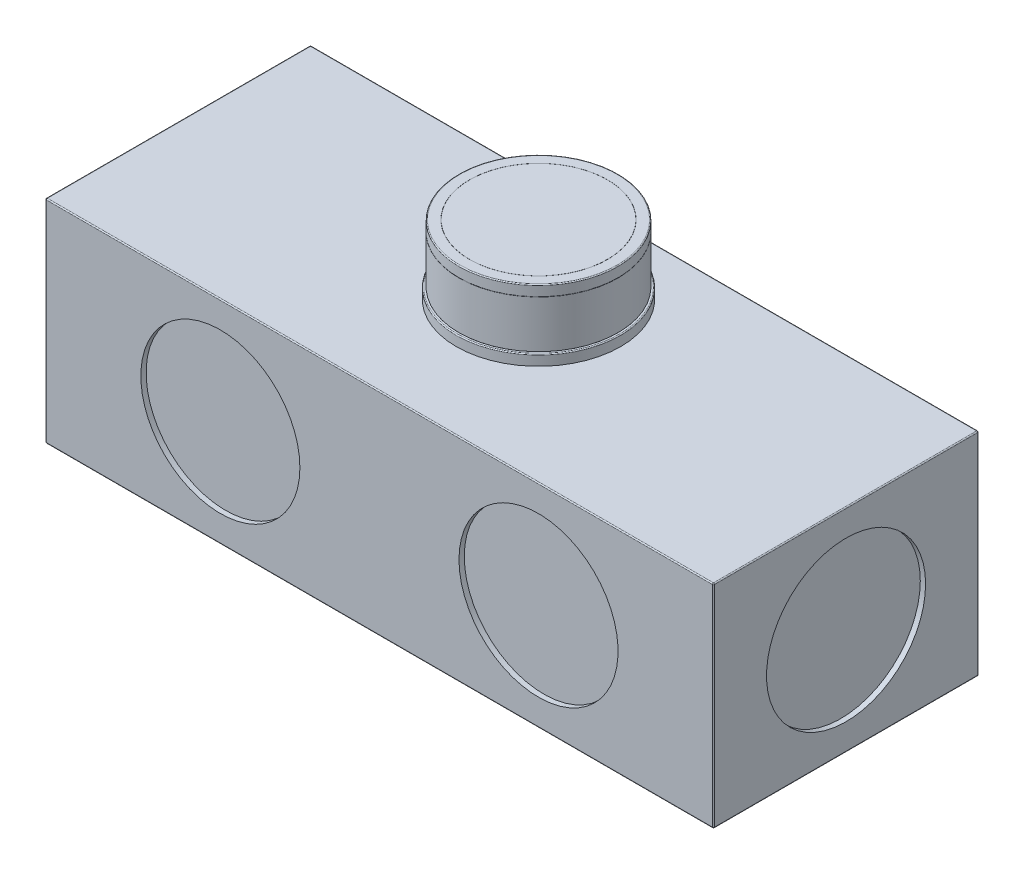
ISO-10303-21;
HEADER;
FILE_DESCRIPTION(('STEP AP214'),'2;1');
FILE_NAME('part.step','',(''),(''),'','','');
FILE_SCHEMA(('AUTOMOTIVE_DESIGN { 1 0 10303 214 1 1 1 1 }'));
ENDSEC;
DATA;
#1=APPLICATION_CONTEXT('core data for automotive mechanical design processes');
#2=APPLICATION_PROTOCOL_DEFINITION('international standard','automotive_design',2000,#1);
#3=PRODUCT_CONTEXT('',#1,'mechanical');
#4=PRODUCT('Part','Part','',(#3));
#5=PRODUCT_RELATED_PRODUCT_CATEGORY('part','',(#4));
#6=PRODUCT_DEFINITION_FORMATION('','',#4);
#7=PRODUCT_DEFINITION_CONTEXT('part definition',#1,'design');
#8=PRODUCT_DEFINITION('design','',#6,#7);
#9=PRODUCT_DEFINITION_SHAPE('','',#8);
#10=(LENGTH_UNIT() NAMED_UNIT(*) SI_UNIT(.MILLI.,.METRE.));
#11=(NAMED_UNIT(*) PLANE_ANGLE_UNIT() SI_UNIT($,.RADIAN.));
#12=(NAMED_UNIT(*) SI_UNIT($,.STERADIAN.) SOLID_ANGLE_UNIT());
#13=UNCERTAINTY_MEASURE_WITH_UNIT(LENGTH_MEASURE(1.E-05),#10,'distance_accuracy_value','');
#14=(GEOMETRIC_REPRESENTATION_CONTEXT(3) GLOBAL_UNCERTAINTY_ASSIGNED_CONTEXT((#13)) GLOBAL_UNIT_ASSIGNED_CONTEXT((#10,
#11,#12)) REPRESENTATION_CONTEXT('',''));
#15=CARTESIAN_POINT('',(0.,0.,0.));
#16=DIRECTION('',(0.,0.,1.));
#17=DIRECTION('',(1.,0.,0.));
#18=AXIS2_PLACEMENT_3D('',#15,#16,#17);
#19=CARTESIAN_POINT('',(-31.5,0.,25.));
#20=DIRECTION('',(1.,0.,0.));
#21=DIRECTION('',(0.,0.,-1.));
#22=AXIS2_PLACEMENT_3D('',#19,#20,#21);
#23=PLANE('',#22);
#24=DIRECTION('',(0.,-1.,0.));
#25=VECTOR('',#24,1.);
#26=CARTESIAN_POINT('',(-31.5,0.,0.0999999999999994));
#27=LINE('',#26,#25);
#28=CARTESIAN_POINT('',(-31.5,19.9,0.0999999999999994));
#29=VERTEX_POINT('',#28);
#30=CARTESIAN_POINT('',(-31.5,0.1,0.0999999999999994));
#31=VERTEX_POINT('',#30);
#32=EDGE_CURVE('E409',#29,#31,#27,.T.);
#33=ORIENTED_EDGE('',*,*,#32,.T.);
#34=DIRECTION('',(0.,0.,-1.));
#35=VECTOR('',#34,1.);
#36=CARTESIAN_POINT('',(-31.5,0.1,25.));
#37=LINE('',#36,#35);
#38=CARTESIAN_POINT('',(-31.5,0.1,24.9));
#39=VERTEX_POINT('',#38);
#40=EDGE_CURVE('E414',#31,#39,#37,.F.);
#41=ORIENTED_EDGE('',*,*,#40,.T.);
#42=DIRECTION('',(0.,-1.,0.));
#43=VECTOR('',#42,1.);
#44=CARTESIAN_POINT('',(-31.5,0.,24.9));
#45=LINE('',#44,#43);
#46=CARTESIAN_POINT('',(-31.5,19.9,24.9));
#47=VERTEX_POINT('',#46);
#48=EDGE_CURVE('E411',#39,#47,#45,.F.);
#49=ORIENTED_EDGE('',*,*,#48,.T.);
#50=DIRECTION('',(0.,0.,-1.));
#51=VECTOR('',#50,1.);
#52=CARTESIAN_POINT('',(-31.5,19.9,25.));
#53=LINE('',#52,#51);
#54=EDGE_CURVE('E407',#47,#29,#53,.T.);
#55=ORIENTED_EDGE('',*,*,#54,.T.);
#56=EDGE_LOOP('',(#33,#41,#49,#55));
#57=FACE_BOUND('',#56,.T.);
#58=CARTESIAN_POINT('',(-31.5,10.,12.5));
#59=DIRECTION('',(-1.,0.,0.));
#60=DIRECTION('',(0.,0.,1.));
#61=AXIS2_PLACEMENT_3D('',#58,#59,#60);
#62=CIRCLE('',#61,7.5);
#63=CARTESIAN_POINT('',(-31.5,10.,20.));
#64=VERTEX_POINT('',#63);
#65=EDGE_CURVE('E354',#64,#64,#62,.T.);
#66=ORIENTED_EDGE('',*,*,#65,.F.);
#67=EDGE_LOOP('',(#66));
#68=FACE_BOUND('',#67,.T.);
#69=ADVANCED_FACE('F34',(#57,#68),#23,.F.);
#70=CARTESIAN_POINT('',(-31.5,0.,25.));
#71=DIRECTION('',(0.,1.,0.));
#72=DIRECTION('',(0.,0.,1.));
#73=AXIS2_PLACEMENT_3D('',#70,#71,#72);
#74=PLANE('',#73);
#75=DIRECTION('',(1.,0.,0.));
#76=VECTOR('',#75,1.);
#77=CARTESIAN_POINT('',(-31.5,0.,24.9));
#78=LINE('',#77,#76);
#79=CARTESIAN_POINT('',(31.4,0.,24.9));
#80=VERTEX_POINT('',#79);
#81=CARTESIAN_POINT('',(-31.4,0.,24.9));
#82=VERTEX_POINT('',#81);
#83=EDGE_CURVE('E402',#80,#82,#78,.F.);
#84=ORIENTED_EDGE('',*,*,#83,.T.);
#85=DIRECTION('',(0.,0.,-1.));
#86=VECTOR('',#85,1.);
#87=CARTESIAN_POINT('',(-31.4,0.,25.));
#88=LINE('',#87,#86);
#89=CARTESIAN_POINT('',(-31.4,0.,0.0999999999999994));
#90=VERTEX_POINT('',#89);
#91=EDGE_CURVE('E405',#82,#90,#88,.T.);
#92=ORIENTED_EDGE('',*,*,#91,.T.);
#93=DIRECTION('',(1.,0.,0.));
#94=VECTOR('',#93,1.);
#95=CARTESIAN_POINT('',(31.5,0.,0.0999999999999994));
#96=LINE('',#95,#94);
#97=CARTESIAN_POINT('',(31.4,0.,0.0999999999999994));
#98=VERTEX_POINT('',#97);
#99=EDGE_CURVE('E400',#90,#98,#96,.T.);
#100=ORIENTED_EDGE('',*,*,#99,.T.);
#101=DIRECTION('',(0.,0.,-1.));
#102=VECTOR('',#101,1.);
#103=CARTESIAN_POINT('',(31.4,0.,25.));
#104=LINE('',#103,#102);
#105=EDGE_CURVE('E398',#98,#80,#104,.F.);
#106=ORIENTED_EDGE('',*,*,#105,.T.);
#107=EDGE_LOOP('',(#84,#92,#100,#106));
#108=FACE_BOUND('',#107,.T.);
#109=CARTESIAN_POINT('',(0.,0.,10.));
#110=DIRECTION('',(0.,1.,0.));
#111=DIRECTION('',(0.,0.,1.));
#112=AXIS2_PLACEMENT_3D('',#109,#110,#111);
#113=CIRCLE('',#112,7.74999999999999);
#114=CARTESIAN_POINT('',(0.,0.,17.75));
#115=VERTEX_POINT('',#114);
#116=EDGE_CURVE('E351',#115,#115,#113,.T.);
#117=ORIENTED_EDGE('',*,*,#116,.T.);
#118=EDGE_LOOP('',(#117));
#119=FACE_BOUND('',#118,.T.);
#120=ADVANCED_FACE('F513',(#108,#119),#74,.F.);
#121=CARTESIAN_POINT('',(31.5,0.,25.));
#122=DIRECTION('',(-1.,0.,0.));
#123=DIRECTION('',(0.,0.,1.));
#124=AXIS2_PLACEMENT_3D('',#121,#122,#123);
#125=PLANE('',#124);
#126=DIRECTION('',(0.,1.,0.));
#127=VECTOR('',#126,1.);
#128=CARTESIAN_POINT('',(31.5,0.,24.9));
#129=LINE('',#128,#127);
#130=CARTESIAN_POINT('',(31.5,19.9,24.9));
#131=VERTEX_POINT('',#130);
#132=CARTESIAN_POINT('',(31.5,0.1,24.9));
#133=VERTEX_POINT('',#132);
#134=EDGE_CURVE('E393',#131,#133,#129,.F.);
#135=ORIENTED_EDGE('',*,*,#134,.T.);
#136=DIRECTION('',(0.,0.,-1.));
#137=VECTOR('',#136,1.);
#138=CARTESIAN_POINT('',(31.5,0.1,25.));
#139=LINE('',#138,#137);
#140=CARTESIAN_POINT('',(31.5,0.1,0.0999999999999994));
#141=VERTEX_POINT('',#140);
#142=EDGE_CURVE('E396',#133,#141,#139,.T.);
#143=ORIENTED_EDGE('',*,*,#142,.T.);
#144=DIRECTION('',(0.,1.,0.));
#145=VECTOR('',#144,1.);
#146=CARTESIAN_POINT('',(31.5,20.,0.0999999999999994));
#147=LINE('',#146,#145);
#148=CARTESIAN_POINT('',(31.5,19.9,0.0999999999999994));
#149=VERTEX_POINT('',#148);
#150=EDGE_CURVE('E391',#141,#149,#147,.T.);
#151=ORIENTED_EDGE('',*,*,#150,.T.);
#152=DIRECTION('',(0.,0.,-1.));
#153=VECTOR('',#152,1.);
#154=CARTESIAN_POINT('',(31.5,19.9,25.));
#155=LINE('',#154,#153);
#156=EDGE_CURVE('E389',#149,#131,#155,.F.);
#157=ORIENTED_EDGE('',*,*,#156,.T.);
#158=EDGE_LOOP('',(#135,#143,#151,#157));
#159=FACE_BOUND('',#158,.T.);
#160=CARTESIAN_POINT('',(31.5,10.,12.5));
#161=DIRECTION('',(1.,0.,0.));
#162=DIRECTION('',(0.,0.,-1.));
#163=AXIS2_PLACEMENT_3D('',#160,#161,#162);
#164=CIRCLE('',#163,7.5);
#165=CARTESIAN_POINT('',(31.5,10.,5.));
#166=VERTEX_POINT('',#165);
#167=EDGE_CURVE('E358',#166,#166,#164,.T.);
#168=ORIENTED_EDGE('',*,*,#167,.F.);
#169=EDGE_LOOP('',(#168));
#170=FACE_BOUND('',#169,.T.);
#171=ADVANCED_FACE('F503',(#159,#170),#125,.F.);
#172=CARTESIAN_POINT('',(-31.5,20.,25.));
#173=DIRECTION('',(0.,-1.,0.));
#174=DIRECTION('',(0.,0.,-1.));
#175=AXIS2_PLACEMENT_3D('',#172,#173,#174);
#176=PLANE('',#175);
#177=DIRECTION('',(-1.,0.,0.));
#178=VECTOR('',#177,1.);
#179=CARTESIAN_POINT('',(-31.5,20.,0.0999999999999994));
#180=LINE('',#179,#178);
#181=CARTESIAN_POINT('',(31.4,20.,0.0999999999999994));
#182=VERTEX_POINT('',#181);
#183=CARTESIAN_POINT('',(-31.4,20.,0.0999999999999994));
#184=VERTEX_POINT('',#183);
#185=EDGE_CURVE('E382',#182,#184,#180,.T.);
#186=ORIENTED_EDGE('',*,*,#185,.T.);
#187=DIRECTION('',(0.,0.,-1.));
#188=VECTOR('',#187,1.);
#189=CARTESIAN_POINT('',(-31.4,20.,25.));
#190=LINE('',#189,#188);
#191=CARTESIAN_POINT('',(-31.4,20.,24.9));
#192=VERTEX_POINT('',#191);
#193=EDGE_CURVE('E387',#184,#192,#190,.F.);
#194=ORIENTED_EDGE('',*,*,#193,.T.);
#195=DIRECTION('',(-1.,0.,0.));
#196=VECTOR('',#195,1.);
#197=CARTESIAN_POINT('',(-31.5,20.,24.9));
#198=LINE('',#197,#196);
#199=CARTESIAN_POINT('',(31.4,20.,24.9));
#200=VERTEX_POINT('',#199);
#201=EDGE_CURVE('E384',#192,#200,#198,.F.);
#202=ORIENTED_EDGE('',*,*,#201,.T.);
#203=DIRECTION('',(0.,0.,-1.));
#204=VECTOR('',#203,1.);
#205=CARTESIAN_POINT('',(31.4,20.,25.));
#206=LINE('',#205,#204);
#207=EDGE_CURVE('E380',#200,#182,#206,.T.);
#208=ORIENTED_EDGE('',*,*,#207,.T.);
#209=EDGE_LOOP('',(#186,#194,#202,#208));
#210=FACE_BOUND('',#209,.T.);
#211=CARTESIAN_POINT('',(0.,20.,10.));
#212=DIRECTION('',(0.,-1.,0.));
#213=DIRECTION('',(0.,0.,-1.));
#214=AXIS2_PLACEMENT_3D('',#211,#212,#213);
#215=CIRCLE('',#214,7.74999999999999);
#216=CARTESIAN_POINT('',(0.,20.,2.25000000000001));
#217=VERTEX_POINT('',#216);
#218=EDGE_CURVE('E350',#217,#217,#215,.T.);
#219=ORIENTED_EDGE('',*,*,#218,.T.);
#220=EDGE_LOOP('',(#219));
#221=FACE_BOUND('',#220,.T.);
#222=ADVANCED_FACE('F547',(#210,#221),#176,.F.);
#223=CARTESIAN_POINT('',(-31.5,20.,25.));
#224=DIRECTION('',(0.,0.,-1.));
#225=DIRECTION('',(-1.,0.,0.));
#226=AXIS2_PLACEMENT_3D('',#223,#224,#225);
#227=PLANE('',#226);
#228=CARTESIAN_POINT('',(15.,10.,25.));
#229=DIRECTION('',(0.,0.,1.));
#230=DIRECTION('',(-1.,0.,0.));
#231=AXIS2_PLACEMENT_3D('',#228,#229,#230);
#232=CIRCLE('',#231,7.5);
#233=CARTESIAN_POINT('',(7.5,10.,25.));
#234=VERTEX_POINT('',#233);
#235=EDGE_CURVE('E1459',#234,#234,#232,.T.);
#236=ORIENTED_EDGE('',*,*,#235,.F.);
#237=EDGE_LOOP('',(#236));
#238=FACE_BOUND('',#237,.T.);
#239=CARTESIAN_POINT('',(-15.,10.,25.));
#240=DIRECTION('',(0.,0.,1.));
#241=DIRECTION('',(1.,0.,0.));
#242=AXIS2_PLACEMENT_3D('',#239,#240,#241);
#243=CIRCLE('',#242,7.5);
#244=CARTESIAN_POINT('',(-7.5,10.,25.));
#245=VERTEX_POINT('',#244);
#246=EDGE_CURVE('E1453',#245,#245,#243,.T.);
#247=ORIENTED_EDGE('',*,*,#246,.F.);
#248=EDGE_LOOP('',(#247));
#249=FACE_BOUND('',#248,.T.);
#250=DIRECTION('',(0.,1.,0.));
#251=VECTOR('',#250,1.);
#252=CARTESIAN_POINT('',(31.4,20.,25.));
#253=LINE('',#252,#251);
#254=CARTESIAN_POINT('',(31.4,0.0999999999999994,25.));
#255=VERTEX_POINT('',#254);
#256=CARTESIAN_POINT('',(31.4,19.9,25.));
#257=VERTEX_POINT('',#256);
#258=EDGE_CURVE('E375',#255,#257,#253,.T.);
#259=ORIENTED_EDGE('',*,*,#258,.T.);
#260=DIRECTION('',(-1.,0.,0.));
#261=VECTOR('',#260,1.);
#262=CARTESIAN_POINT('',(-31.5,19.9,25.));
#263=LINE('',#262,#261);
#264=CARTESIAN_POINT('',(-31.4,19.9,25.));
#265=VERTEX_POINT('',#264);
#266=EDGE_CURVE('E377',#257,#265,#263,.T.);
#267=ORIENTED_EDGE('',*,*,#266,.T.);
#268=DIRECTION('',(0.,-1.,0.));
#269=VECTOR('',#268,1.);
#270=CARTESIAN_POINT('',(-31.4,20.,25.));
#271=LINE('',#270,#269);
#272=CARTESIAN_POINT('',(-31.4,0.0999999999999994,25.));
#273=VERTEX_POINT('',#272);
#274=EDGE_CURVE('E371',#265,#273,#271,.T.);
#275=ORIENTED_EDGE('',*,*,#274,.T.);
#276=DIRECTION('',(1.,0.,0.));
#277=VECTOR('',#276,1.);
#278=CARTESIAN_POINT('',(-31.5,0.0999999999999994,25.));
#279=LINE('',#278,#277);
#280=EDGE_CURVE('E373',#273,#255,#279,.T.);
#281=ORIENTED_EDGE('',*,*,#280,.T.);
#282=EDGE_LOOP('',(#259,#267,#275,#281));
#283=FACE_BOUND('',#282,.T.);
#284=ADVANCED_FACE('F1192',(#238,#249,#283),#227,.F.);
#285=CARTESIAN_POINT('',(-31.5,20.,0.));
#286=DIRECTION('',(0.,0.,-1.));
#287=DIRECTION('',(-1.,0.,0.));
#288=AXIS2_PLACEMENT_3D('',#285,#286,#287);
#289=PLANE('',#288);
#290=DIRECTION('',(0.,1.,0.));
#291=VECTOR('',#290,1.);
#292=CARTESIAN_POINT('',(31.4,0.,0.));
#293=LINE('',#292,#291);
#294=CARTESIAN_POINT('',(31.4,19.9,0.));
#295=VERTEX_POINT('',#294);
#296=CARTESIAN_POINT('',(31.4,0.1,0.));
#297=VERTEX_POINT('',#296);
#298=EDGE_CURVE('E43',#295,#297,#293,.F.);
#299=ORIENTED_EDGE('',*,*,#298,.T.);
#300=DIRECTION('',(1.,0.,0.));
#301=VECTOR('',#300,1.);
#302=CARTESIAN_POINT('',(-31.5,0.1,0.));
#303=LINE('',#302,#301);
#304=CARTESIAN_POINT('',(-31.4,0.1,0.));
#305=VERTEX_POINT('',#304);
#306=EDGE_CURVE('E11',#297,#305,#303,.F.);
#307=ORIENTED_EDGE('',*,*,#306,.T.);
#308=DIRECTION('',(0.,-1.,0.));
#309=VECTOR('',#308,1.);
#310=CARTESIAN_POINT('',(-31.4,20.,0.));
#311=LINE('',#310,#309);
#312=CARTESIAN_POINT('',(-31.4,19.9,0.));
#313=VERTEX_POINT('',#312);
#314=EDGE_CURVE('E416',#305,#313,#311,.F.);
#315=ORIENTED_EDGE('',*,*,#314,.T.);
#316=DIRECTION('',(-1.,0.,0.));
#317=VECTOR('',#316,1.);
#318=CARTESIAN_POINT('',(31.5,19.9,0.));
#319=LINE('',#318,#317);
#320=EDGE_CURVE('E54',#313,#295,#319,.F.);
#321=ORIENTED_EDGE('',*,*,#320,.T.);
#322=EDGE_LOOP('',(#299,#307,#315,#321));
#323=FACE_BOUND('',#322,.T.);
#324=ADVANCED_FACE('F528',(#323),#289,.T.);
#325=CARTESIAN_POINT('',(31.,10.,12.5));
#326=DIRECTION('',(1.,0.,0.));
#327=DIRECTION('',(0.,0.,-1.));
#328=AXIS2_PLACEMENT_3D('',#325,#326,#327);
#329=CYLINDRICAL_SURFACE('',#328,7.5);
#330=CARTESIAN_POINT('',(31.,10.,12.5));
#331=DIRECTION('',(1.,0.,0.));
#332=DIRECTION('',(0.,0.,-1.));
#333=AXIS2_PLACEMENT_3D('',#330,#331,#332);
#334=CIRCLE('',#333,7.5);
#335=CARTESIAN_POINT('',(31.,10.,5.));
#336=VERTEX_POINT('',#335);
#337=EDGE_CURVE('E361',#336,#336,#334,.T.);
#338=ORIENTED_EDGE('',*,*,#337,.F.);
#339=EDGE_LOOP('',(#338));
#340=FACE_BOUND('',#339,.T.);
#341=ORIENTED_EDGE('',*,*,#167,.T.);
#342=EDGE_LOOP('',(#341));
#343=FACE_BOUND('',#342,.T.);
#344=ADVANCED_FACE('F1176',(#340,#343),#329,.F.);
#345=CARTESIAN_POINT('',(31.,10.,12.5));
#346=DIRECTION('',(1.,0.,0.));
#347=DIRECTION('',(0.,0.,-1.));
#348=AXIS2_PLACEMENT_3D('',#345,#346,#347);
#349=PLANE('',#348);
#350=ORIENTED_EDGE('',*,*,#337,.T.);
#351=EDGE_LOOP('',(#350));
#352=FACE_BOUND('',#351,.T.);
#353=ADVANCED_FACE('F1167',(#352),#349,.T.);
#354=CARTESIAN_POINT('',(-31.,10.,12.5));
#355=DIRECTION('',(-1.,0.,0.));
#356=DIRECTION('',(0.,0.,1.));
#357=AXIS2_PLACEMENT_3D('',#354,#355,#356);
#358=CYLINDRICAL_SURFACE('',#357,7.5);
#359=CARTESIAN_POINT('',(-31.,10.,12.5));
#360=DIRECTION('',(-1.,0.,0.));
#361=DIRECTION('',(0.,0.,1.));
#362=AXIS2_PLACEMENT_3D('',#359,#360,#361);
#363=CIRCLE('',#362,7.5);
#364=CARTESIAN_POINT('',(-31.,10.,20.));
#365=VERTEX_POINT('',#364);
#366=EDGE_CURVE('E355',#365,#365,#363,.T.);
#367=ORIENTED_EDGE('',*,*,#366,.F.);
#368=EDGE_LOOP('',(#367));
#369=FACE_BOUND('',#368,.T.);
#370=ORIENTED_EDGE('',*,*,#65,.T.);
#371=EDGE_LOOP('',(#370));
#372=FACE_BOUND('',#371,.T.);
#373=ADVANCED_FACE('F1158',(#369,#372),#358,.F.);
#374=CARTESIAN_POINT('',(-31.,10.,12.5));
#375=DIRECTION('',(-1.,0.,0.));
#376=DIRECTION('',(0.,0.,1.));
#377=AXIS2_PLACEMENT_3D('',#374,#375,#376);
#378=PLANE('',#377);
#379=ORIENTED_EDGE('',*,*,#366,.T.);
#380=EDGE_LOOP('',(#379));
#381=FACE_BOUND('',#380,.T.);
#382=ADVANCED_FACE('F1148',(#381),#378,.T.);
#383=CARTESIAN_POINT('',(0.,20.91,10.));
#384=DIRECTION('',(0.,1.,0.));
#385=DIRECTION('',(0.,0.,1.));
#386=AXIS2_PLACEMENT_3D('',#383,#384,#385);
#387=TOROIDAL_SURFACE('',#386,7.66,0.0899999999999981);
#388=CARTESIAN_POINT('',(0.,20.91,10.));
#389=DIRECTION('',(0.,1.,0.));
#390=DIRECTION('',(0.,0.,1.));
#391=AXIS2_PLACEMENT_3D('',#388,#389,#390);
#392=CIRCLE('',#391,7.74999999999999);
#393=CARTESIAN_POINT('',(0.,20.91,17.75));
#394=VERTEX_POINT('',#393);
#395=EDGE_CURVE('E296',#394,#394,#392,.T.);
#396=ORIENTED_EDGE('',*,*,#395,.T.);
#397=EDGE_LOOP('',(#396));
#398=FACE_BOUND('',#397,.T.);
#399=CARTESIAN_POINT('',(0.,21.,10.));
#400=DIRECTION('',(0.,1.,0.));
#401=DIRECTION('',(0.,0.,1.));
#402=AXIS2_PLACEMENT_3D('',#399,#400,#401);
#403=CIRCLE('',#402,7.66);
#404=CARTESIAN_POINT('',(0.,21.,17.66));
#405=VERTEX_POINT('',#404);
#406=EDGE_CURVE('E299',#405,#405,#403,.T.);
#407=ORIENTED_EDGE('',*,*,#406,.F.);
#408=EDGE_LOOP('',(#407));
#409=FACE_BOUND('',#408,.T.);
#410=ADVANCED_FACE('F1139',(#398,#409),#387,.T.);
#411=CARTESIAN_POINT('',(0.,21.,17.66));
#412=DIRECTION('',(0.,1.,0.));
#413=DIRECTION('',(0.,0.,1.));
#414=AXIS2_PLACEMENT_3D('',#411,#412,#413);
#415=PLANE('',#414);
#416=ORIENTED_EDGE('',*,*,#406,.T.);
#417=EDGE_LOOP('',(#416));
#418=FACE_BOUND('',#417,.T.);
#419=CARTESIAN_POINT('',(0.,21.,10.));
#420=DIRECTION('',(0.,1.,0.));
#421=DIRECTION('',(0.,0.,1.));
#422=AXIS2_PLACEMENT_3D('',#419,#420,#421);
#423=CIRCLE('',#422,7.4);
#424=CARTESIAN_POINT('',(0.,21.,17.4));
#425=VERTEX_POINT('',#424);
#426=EDGE_CURVE('E302',#425,#425,#423,.T.);
#427=ORIENTED_EDGE('',*,*,#426,.F.);
#428=EDGE_LOOP('',(#427));
#429=FACE_BOUND('',#428,.T.);
#430=ADVANCED_FACE('F1130',(#418,#429),#415,.T.);
#431=CARTESIAN_POINT('',(0.,26.5,10.));
#432=DIRECTION('',(0.,1.,0.));
#433=DIRECTION('',(0.,0.,1.));
#434=AXIS2_PLACEMENT_3D('',#431,#432,#433);
#435=CYLINDRICAL_SURFACE('',#434,7.4);
#436=ORIENTED_EDGE('',*,*,#426,.T.);
#437=EDGE_LOOP('',(#436));
#438=FACE_BOUND('',#437,.T.);
#439=CARTESIAN_POINT('',(0.,21.01,10.));
#440=DIRECTION('',(0.,1.,0.));
#441=DIRECTION('',(0.,0.,1.));
#442=AXIS2_PLACEMENT_3D('',#439,#440,#441);
#443=CIRCLE('',#442,7.4);
#444=CARTESIAN_POINT('',(0.,21.01,17.4));
#445=VERTEX_POINT('',#444);
#446=EDGE_CURVE('E305',#445,#445,#443,.T.);
#447=ORIENTED_EDGE('',*,*,#446,.F.);
#448=EDGE_LOOP('',(#447));
#449=FACE_BOUND('',#448,.T.);
#450=ADVANCED_FACE('F1121',(#438,#449),#435,.T.);
#451=CARTESIAN_POINT('',(0.,21.01,17.4));
#452=DIRECTION('',(0.,-1.,0.));
#453=DIRECTION('',(0.,0.,-1.));
#454=AXIS2_PLACEMENT_3D('',#451,#452,#453);
#455=PLANE('',#454);
#456=ORIENTED_EDGE('',*,*,#446,.T.);
#457=EDGE_LOOP('',(#456));
#458=FACE_BOUND('',#457,.T.);
#459=CARTESIAN_POINT('',(0.,21.01,10.));
#460=DIRECTION('',(0.,1.,0.));
#461=DIRECTION('',(0.,0.,1.));
#462=AXIS2_PLACEMENT_3D('',#459,#460,#461);
#463=CIRCLE('',#462,7.491);
#464=CARTESIAN_POINT('',(0.,21.01,17.491));
#465=VERTEX_POINT('',#464);
#466=EDGE_CURVE('E308',#465,#465,#463,.T.);
#467=ORIENTED_EDGE('',*,*,#466,.F.);
#468=EDGE_LOOP('',(#467));
#469=FACE_BOUND('',#468,.T.);
#470=ADVANCED_FACE('F1112',(#458,#469),#455,.T.);
#471=CARTESIAN_POINT('',(0.,21.019,10.));
#472=DIRECTION('',(0.,1.,0.));
#473=DIRECTION('',(0.,0.,1.));
#474=AXIS2_PLACEMENT_3D('',#471,#472,#473);
#475=TOROIDAL_SURFACE('',#474,7.491,0.00899999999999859);
#476=ORIENTED_EDGE('',*,*,#466,.T.);
#477=EDGE_LOOP('',(#476));
#478=FACE_BOUND('',#477,.T.);
#479=CARTESIAN_POINT('',(0.,21.019,10.));
#480=DIRECTION('',(0.,1.,0.));
#481=DIRECTION('',(0.,0.,1.));
#482=AXIS2_PLACEMENT_3D('',#479,#480,#481);
#483=CIRCLE('',#482,7.5);
#484=CARTESIAN_POINT('',(0.,21.019,17.5));
#485=VERTEX_POINT('',#484);
#486=EDGE_CURVE('E311',#485,#485,#483,.T.);
#487=ORIENTED_EDGE('',*,*,#486,.F.);
#488=EDGE_LOOP('',(#487));
#489=FACE_BOUND('',#488,.T.);
#490=ADVANCED_FACE('F1103',(#478,#489),#475,.T.);
#491=CARTESIAN_POINT('',(0.,26.5,10.));
#492=DIRECTION('',(0.,1.,0.));
#493=DIRECTION('',(0.,0.,1.));
#494=AXIS2_PLACEMENT_3D('',#491,#492,#493);
#495=CYLINDRICAL_SURFACE('',#494,7.5);
#496=ORIENTED_EDGE('',*,*,#486,.T.);
#497=EDGE_LOOP('',(#496));
#498=FACE_BOUND('',#497,.T.);
#499=CARTESIAN_POINT('',(0.,25.481,10.));
#500=DIRECTION('',(0.,1.,0.));
#501=DIRECTION('',(0.,0.,1.));
#502=AXIS2_PLACEMENT_3D('',#499,#500,#501);
#503=CIRCLE('',#502,7.5);
#504=CARTESIAN_POINT('',(0.,25.481,17.5));
#505=VERTEX_POINT('',#504);
#506=EDGE_CURVE('E314',#505,#505,#503,.T.);
#507=ORIENTED_EDGE('',*,*,#506,.F.);
#508=EDGE_LOOP('',(#507));
#509=FACE_BOUND('',#508,.T.);
#510=ADVANCED_FACE('F1094',(#498,#509),#495,.T.);
#511=CARTESIAN_POINT('',(0.,25.481,10.));
#512=DIRECTION('',(0.,1.,0.));
#513=DIRECTION('',(0.,0.,1.));
#514=AXIS2_PLACEMENT_3D('',#511,#512,#513);
#515=TOROIDAL_SURFACE('',#514,7.491,0.00899999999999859);
#516=ORIENTED_EDGE('',*,*,#506,.T.);
#517=EDGE_LOOP('',(#516));
#518=FACE_BOUND('',#517,.T.);
#519=CARTESIAN_POINT('',(0.,25.49,10.));
#520=DIRECTION('',(0.,1.,0.));
#521=DIRECTION('',(0.,0.,1.));
#522=AXIS2_PLACEMENT_3D('',#519,#520,#521);
#523=CIRCLE('',#522,7.491);
#524=CARTESIAN_POINT('',(0.,25.49,17.491));
#525=VERTEX_POINT('',#524);
#526=EDGE_CURVE('E317',#525,#525,#523,.T.);
#527=ORIENTED_EDGE('',*,*,#526,.F.);
#528=EDGE_LOOP('',(#527));
#529=FACE_BOUND('',#528,.T.);
#530=ADVANCED_FACE('F1085',(#518,#529),#515,.T.);
#531=CARTESIAN_POINT('',(0.,25.49,17.491));
#532=DIRECTION('',(0.,1.,0.));
#533=DIRECTION('',(0.,0.,1.));
#534=AXIS2_PLACEMENT_3D('',#531,#532,#533);
#535=PLANE('',#534);
#536=ORIENTED_EDGE('',*,*,#526,.T.);
#537=EDGE_LOOP('',(#536));
#538=FACE_BOUND('',#537,.T.);
#539=CARTESIAN_POINT('',(0.,25.49,10.));
#540=DIRECTION('',(0.,1.,0.));
#541=DIRECTION('',(0.,0.,1.));
#542=AXIS2_PLACEMENT_3D('',#539,#540,#541);
#543=CIRCLE('',#542,7.49);
#544=CARTESIAN_POINT('',(0.,25.49,17.49));
#545=VERTEX_POINT('',#544);
#546=EDGE_CURVE('E320',#545,#545,#543,.T.);
#547=ORIENTED_EDGE('',*,*,#546,.F.);
#548=EDGE_LOOP('',(#547));
#549=FACE_BOUND('',#548,.T.);
#550=ADVANCED_FACE('F1076',(#538,#549),#535,.T.);
#551=CARTESIAN_POINT('',(0.,26.5,10.));
#552=DIRECTION('',(0.,1.,0.));
#553=DIRECTION('',(0.,0.,1.));
#554=AXIS2_PLACEMENT_3D('',#551,#552,#553);
#555=CYLINDRICAL_SURFACE('',#554,7.49);
#556=ORIENTED_EDGE('',*,*,#546,.T.);
#557=EDGE_LOOP('',(#556));
#558=FACE_BOUND('',#557,.T.);
#559=CARTESIAN_POINT('',(0.,25.5,10.));
#560=DIRECTION('',(0.,1.,0.));
#561=DIRECTION('',(0.,0.,1.));
#562=AXIS2_PLACEMENT_3D('',#559,#560,#561);
#563=CIRCLE('',#562,7.49000000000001);
#564=CARTESIAN_POINT('',(0.,25.5,17.49));
#565=VERTEX_POINT('',#564);
#566=EDGE_CURVE('E323',#565,#565,#563,.T.);
#567=ORIENTED_EDGE('',*,*,#566,.F.);
#568=EDGE_LOOP('',(#567));
#569=FACE_BOUND('',#568,.T.);
#570=ADVANCED_FACE('F1067',(#558,#569),#555,.T.);
#571=CARTESIAN_POINT('',(0.,25.5,17.49));
#572=DIRECTION('',(0.,-1.,0.));
#573=DIRECTION('',(0.,0.,-1.));
#574=AXIS2_PLACEMENT_3D('',#571,#572,#573);
#575=PLANE('',#574);
#576=ORIENTED_EDGE('',*,*,#566,.T.);
#577=EDGE_LOOP('',(#576));
#578=FACE_BOUND('',#577,.T.);
#579=CARTESIAN_POINT('',(0.,25.5,10.));
#580=DIRECTION('',(0.,1.,0.));
#581=DIRECTION('',(0.,0.,1.));
#582=AXIS2_PLACEMENT_3D('',#579,#580,#581);
#583=CIRCLE('',#582,7.491);
#584=CARTESIAN_POINT('',(0.,25.5,17.491));
#585=VERTEX_POINT('',#584);
#586=EDGE_CURVE('E326',#585,#585,#583,.T.);
#587=ORIENTED_EDGE('',*,*,#586,.F.);
#588=EDGE_LOOP('',(#587));
#589=FACE_BOUND('',#588,.T.);
#590=ADVANCED_FACE('F1058',(#578,#589),#575,.T.);
#591=CARTESIAN_POINT('',(0.,25.509,10.));
#592=DIRECTION('',(0.,1.,0.));
#593=DIRECTION('',(0.,0.,1.));
#594=AXIS2_PLACEMENT_3D('',#591,#592,#593);
#595=TOROIDAL_SURFACE('',#594,7.491,0.00899999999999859);
#596=ORIENTED_EDGE('',*,*,#586,.T.);
#597=EDGE_LOOP('',(#596));
#598=FACE_BOUND('',#597,.T.);
#599=CARTESIAN_POINT('',(0.,25.509,10.));
#600=DIRECTION('',(0.,1.,0.));
#601=DIRECTION('',(0.,0.,1.));
#602=AXIS2_PLACEMENT_3D('',#599,#600,#601);
#603=CIRCLE('',#602,7.5);
#604=CARTESIAN_POINT('',(0.,25.509,17.5));
#605=VERTEX_POINT('',#604);
#606=EDGE_CURVE('E329',#605,#605,#603,.T.);
#607=ORIENTED_EDGE('',*,*,#606,.F.);
#608=EDGE_LOOP('',(#607));
#609=FACE_BOUND('',#608,.T.);
#610=ADVANCED_FACE('F1048',(#598,#609),#595,.T.);
#611=CARTESIAN_POINT('',(0.,26.5,10.));
#612=DIRECTION('',(0.,1.,0.));
#613=DIRECTION('',(0.,0.,1.));
#614=AXIS2_PLACEMENT_3D('',#611,#612,#613);
#615=CYLINDRICAL_SURFACE('',#614,7.5);
#616=ORIENTED_EDGE('',*,*,#606,.T.);
#617=EDGE_LOOP('',(#616));
#618=FACE_BOUND('',#617,.T.);
#619=CARTESIAN_POINT('',(0.,26.41,10.));
#620=DIRECTION('',(0.,1.,0.));
#621=DIRECTION('',(0.,0.,1.));
#622=AXIS2_PLACEMENT_3D('',#619,#620,#621);
#623=CIRCLE('',#622,7.5);
#624=CARTESIAN_POINT('',(0.,26.41,17.5));
#625=VERTEX_POINT('',#624);
#626=EDGE_CURVE('E332',#625,#625,#623,.T.);
#627=ORIENTED_EDGE('',*,*,#626,.F.);
#628=EDGE_LOOP('',(#627));
#629=FACE_BOUND('',#628,.T.);
#630=ADVANCED_FACE('F1038',(#618,#629),#615,.T.);
#631=CARTESIAN_POINT('',(0.,26.41,10.));
#632=DIRECTION('',(0.,1.,0.));
#633=DIRECTION('',(0.,0.,1.));
#634=AXIS2_PLACEMENT_3D('',#631,#632,#633);
#635=TOROIDAL_SURFACE('',#634,7.41,0.0899999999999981);
#636=ORIENTED_EDGE('',*,*,#626,.T.);
#637=EDGE_LOOP('',(#636));
#638=FACE_BOUND('',#637,.T.);
#639=CARTESIAN_POINT('',(0.,26.5,10.));
#640=DIRECTION('',(0.,1.,0.));
#641=DIRECTION('',(0.,0.,1.));
#642=AXIS2_PLACEMENT_3D('',#639,#640,#641);
#643=CIRCLE('',#642,7.41);
#644=CARTESIAN_POINT('',(0.,26.5,17.41));
#645=VERTEX_POINT('',#644);
#646=EDGE_CURVE('E335',#645,#645,#643,.T.);
#647=ORIENTED_EDGE('',*,*,#646,.F.);
#648=EDGE_LOOP('',(#647));
#649=FACE_BOUND('',#648,.T.);
#650=ADVANCED_FACE('F1028',(#638,#649),#635,.T.);
#651=CARTESIAN_POINT('',(0.,26.5,17.41));
#652=DIRECTION('',(0.,1.,0.));
#653=DIRECTION('',(0.,0.,1.));
#654=AXIS2_PLACEMENT_3D('',#651,#652,#653);
#655=PLANE('',#654);
#656=ORIENTED_EDGE('',*,*,#646,.T.);
#657=EDGE_LOOP('',(#656));
#658=FACE_BOUND('',#657,.T.);
#659=CARTESIAN_POINT('',(0.,26.5,10.));
#660=DIRECTION('',(0.,1.,0.));
#661=DIRECTION('',(0.,0.,1.));
#662=AXIS2_PLACEMENT_3D('',#659,#660,#661);
#663=CIRCLE('',#662,6.51);
#664=CARTESIAN_POINT('',(0.,26.5,16.51));
#665=VERTEX_POINT('',#664);
#666=EDGE_CURVE('E338',#665,#665,#663,.T.);
#667=ORIENTED_EDGE('',*,*,#666,.F.);
#668=EDGE_LOOP('',(#667));
#669=FACE_BOUND('',#668,.T.);
#670=ADVANCED_FACE('F1019',(#658,#669),#655,.T.);
#671=CARTESIAN_POINT('',(0.,26.5,10.));
#672=DIRECTION('',(0.,1.,0.));
#673=DIRECTION('',(0.,0.,1.));
#674=AXIS2_PLACEMENT_3D('',#671,#672,#673);
#675=CYLINDRICAL_SURFACE('',#674,6.51);
#676=ORIENTED_EDGE('',*,*,#666,.T.);
#677=EDGE_LOOP('',(#676));
#678=FACE_BOUND('',#677,.T.);
#679=CARTESIAN_POINT('',(0.,26.4,10.));
#680=DIRECTION('',(0.,1.,0.));
#681=DIRECTION('',(0.,0.,1.));
#682=AXIS2_PLACEMENT_3D('',#679,#680,#681);
#683=CIRCLE('',#682,6.51);
#684=CARTESIAN_POINT('',(0.,26.4,16.51));
#685=VERTEX_POINT('',#684);
#686=EDGE_CURVE('E341',#685,#685,#683,.T.);
#687=ORIENTED_EDGE('',*,*,#686,.F.);
#688=EDGE_LOOP('',(#687));
#689=FACE_BOUND('',#688,.T.);
#690=ADVANCED_FACE('F1010',(#678,#689),#675,.F.);
#691=CARTESIAN_POINT('',(0.,26.4,16.51));
#692=DIRECTION('',(0.,1.,0.));
#693=DIRECTION('',(0.,0.,1.));
#694=AXIS2_PLACEMENT_3D('',#691,#692,#693);
#695=PLANE('',#694);
#696=ORIENTED_EDGE('',*,*,#686,.T.);
#697=EDGE_LOOP('',(#696));
#698=FACE_BOUND('',#697,.T.);
#699=CARTESIAN_POINT('',(0.,26.4,10.));
#700=DIRECTION('',(0.,1.,0.));
#701=DIRECTION('',(0.,0.,1.));
#702=AXIS2_PLACEMENT_3D('',#699,#700,#701);
#703=CIRCLE('',#702,6.5);
#704=CARTESIAN_POINT('',(0.,26.4,16.5));
#705=VERTEX_POINT('',#704);
#706=EDGE_CURVE('E344',#705,#705,#703,.T.);
#707=ORIENTED_EDGE('',*,*,#706,.F.);
#708=EDGE_LOOP('',(#707));
#709=FACE_BOUND('',#708,.T.);
#710=ADVANCED_FACE('F1001',(#698,#709),#695,.T.);
#711=CARTESIAN_POINT('',(0.,26.5,10.));
#712=DIRECTION('',(0.,1.,0.));
#713=DIRECTION('',(0.,0.,1.));
#714=AXIS2_PLACEMENT_3D('',#711,#712,#713);
#715=CYLINDRICAL_SURFACE('',#714,6.5);
#716=ORIENTED_EDGE('',*,*,#706,.T.);
#717=EDGE_LOOP('',(#716));
#718=FACE_BOUND('',#717,.T.);
#719=CARTESIAN_POINT('',(0.,26.5,10.));
#720=DIRECTION('',(0.,1.,0.));
#721=DIRECTION('',(0.,0.,1.));
#722=AXIS2_PLACEMENT_3D('',#719,#720,#721);
#723=CIRCLE('',#722,6.5);
#724=CARTESIAN_POINT('',(0.,26.5,16.5));
#725=VERTEX_POINT('',#724);
#726=EDGE_CURVE('E347',#725,#725,#723,.T.);
#727=ORIENTED_EDGE('',*,*,#726,.F.);
#728=EDGE_LOOP('',(#727));
#729=FACE_BOUND('',#728,.T.);
#730=ADVANCED_FACE('F992',(#718,#729),#715,.T.);
#731=CARTESIAN_POINT('',(0.,26.5,16.5));
#732=DIRECTION('',(0.,1.,0.));
#733=DIRECTION('',(0.,0.,1.));
#734=AXIS2_PLACEMENT_3D('',#731,#732,#733);
#735=PLANE('',#734);
#736=ORIENTED_EDGE('',*,*,#726,.T.);
#737=EDGE_LOOP('',(#736));
#738=FACE_BOUND('',#737,.T.);
#739=ADVANCED_FACE('F983',(#738),#735,.T.);
#740=CARTESIAN_POINT('',(0.,26.5,10.));
#741=DIRECTION('',(0.,1.,0.));
#742=DIRECTION('',(0.,0.,1.));
#743=AXIS2_PLACEMENT_3D('',#740,#741,#742);
#744=CYLINDRICAL_SURFACE('',#743,7.74999999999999);
#745=ORIENTED_EDGE('',*,*,#395,.F.);
#746=EDGE_LOOP('',(#745));
#747=FACE_BOUND('',#746,.T.);
#748=ORIENTED_EDGE('',*,*,#218,.F.);
#749=EDGE_LOOP('',(#748));
#750=FACE_BOUND('',#749,.T.);
#751=ADVANCED_FACE('F973',(#747,#750),#744,.T.);
#752=CARTESIAN_POINT('',(0.,-0.809999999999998,10.));
#753=DIRECTION('',(0.,1.,0.));
#754=DIRECTION('',(0.,0.,1.));
#755=AXIS2_PLACEMENT_3D('',#752,#753,#754);
#756=CIRCLE('',#755,7.75);
#757=CARTESIAN_POINT('',(0.,-0.809999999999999,17.75));
#758=VERTEX_POINT('',#757);
#759=EDGE_CURVE('E293',#758,#758,#756,.T.);
#760=ORIENTED_EDGE('',*,*,#759,.T.);
#761=EDGE_LOOP('',(#760));
#762=FACE_BOUND('',#761,.T.);
#763=ORIENTED_EDGE('',*,*,#116,.F.);
#764=EDGE_LOOP('',(#763));
#765=FACE_BOUND('',#764,.T.);
#766=ADVANCED_FACE('F963',(#762,#765),#744,.T.);
#767=CARTESIAN_POINT('',(0.,-0.81,10.));
#768=DIRECTION('',(0.,1.,0.));
#769=DIRECTION('',(0.,0.,1.));
#770=AXIS2_PLACEMENT_3D('',#767,#768,#769);
#771=TOROIDAL_SURFACE('',#770,7.66,0.0899999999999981);
#772=CARTESIAN_POINT('',(0.,-0.900000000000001,10.));
#773=DIRECTION('',(0.,1.,0.));
#774=DIRECTION('',(0.,0.,1.));
#775=AXIS2_PLACEMENT_3D('',#772,#773,#774);
#776=CIRCLE('',#775,7.66);
#777=CARTESIAN_POINT('',(0.,-0.900000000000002,17.66));
#778=VERTEX_POINT('',#777);
#779=EDGE_CURVE('E290',#778,#778,#776,.T.);
#780=ORIENTED_EDGE('',*,*,#779,.T.);
#781=EDGE_LOOP('',(#780));
#782=FACE_BOUND('',#781,.T.);
#783=ORIENTED_EDGE('',*,*,#759,.F.);
#784=EDGE_LOOP('',(#783));
#785=FACE_BOUND('',#784,.T.);
#786=ADVANCED_FACE('F953',(#782,#785),#771,.T.);
#787=CARTESIAN_POINT('',(0.,-0.9,17.66));
#788=DIRECTION('',(0.,-1.,0.));
#789=DIRECTION('',(0.,0.,-1.));
#790=AXIS2_PLACEMENT_3D('',#787,#788,#789);
#791=PLANE('',#790);
#792=CARTESIAN_POINT('',(0.,-0.900000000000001,10.));
#793=DIRECTION('',(0.,1.,0.));
#794=DIRECTION('',(0.,0.,1.));
#795=AXIS2_PLACEMENT_3D('',#792,#793,#794);
#796=CIRCLE('',#795,4.75);
#797=CARTESIAN_POINT('',(0.,-0.900000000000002,14.75));
#798=VERTEX_POINT('',#797);
#799=EDGE_CURVE('E287',#798,#798,#796,.T.);
#800=ORIENTED_EDGE('',*,*,#799,.T.);
#801=EDGE_LOOP('',(#800));
#802=FACE_BOUND('',#801,.T.);
#803=ORIENTED_EDGE('',*,*,#779,.F.);
#804=EDGE_LOOP('',(#803));
#805=FACE_BOUND('',#804,.T.);
#806=ADVANCED_FACE('F944',(#802,#805),#791,.T.);
#807=CARTESIAN_POINT('',(0.,26.5,10.));
#808=DIRECTION('',(0.,1.,0.));
#809=DIRECTION('',(0.,0.,1.));
#810=AXIS2_PLACEMENT_3D('',#807,#808,#809);
#811=CYLINDRICAL_SURFACE('',#810,4.75);
#812=CARTESIAN_POINT('',(0.,-1.,10.));
#813=DIRECTION('',(0.,-1.,0.));
#814=DIRECTION('',(0.,0.,-1.));
#815=AXIS2_PLACEMENT_3D('',#812,#813,#814);
#816=CIRCLE('',#815,4.75);
#817=CARTESIAN_POINT('',(0.,-1.,5.25));
#818=VERTEX_POINT('',#817);
#819=EDGE_CURVE('E284',#818,#818,#816,.F.);
#820=ORIENTED_EDGE('',*,*,#819,.T.);
#821=EDGE_LOOP('',(#820));
#822=FACE_BOUND('',#821,.T.);
#823=ORIENTED_EDGE('',*,*,#799,.F.);
#824=EDGE_LOOP('',(#823));
#825=FACE_BOUND('',#824,.T.);
#826=ADVANCED_FACE('F935',(#822,#825),#811,.T.);
#827=CARTESIAN_POINT('',(6.74999999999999,-7.5,13.89711431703));
#828=DIRECTION('',(-0.5,0.,-0.866025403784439));
#829=DIRECTION('',(-0.866025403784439,0.,0.5));
#830=AXIS2_PLACEMENT_3D('',#827,#828,#829);
#831=PLANE('',#830);
#832=DIRECTION('',(0.,1.,0.));
#833=VECTOR('',#832,1.);
#834=CARTESIAN_POINT('',(6.74999999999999,-7.5,13.89711431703));
#835=LINE('',#834,#833);
#836=CARTESIAN_POINT('',(6.74999999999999,-6.86936374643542,13.89711431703));
#837=VERTEX_POINT('',#836);
#838=CARTESIAN_POINT('',(6.74999999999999,-1.63045717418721,13.89711431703));
#839=VERTEX_POINT('',#838);
#840=EDGE_CURVE('E267',#837,#839,#835,.T.);
#841=ORIENTED_EDGE('',*,*,#840,.T.);
#842=CARTESIAN_POINT('',(11.4500961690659,-4.04711510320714,11.1835125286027));
#843=CARTESIAN_POINT('',(11.2554692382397,-3.92877406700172,11.2958804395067));
#844=CARTESIAN_POINT('',(11.0603259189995,-3.81155092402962,11.4085464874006));
#845=CARTESIAN_POINT('',(10.6688066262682,-3.57982351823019,11.6345902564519));
#846=CARTESIAN_POINT('',(10.4724305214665,-3.46531955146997,11.7479680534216));
#847=CARTESIAN_POINT('',(10.0777394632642,-3.23922529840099,11.9758430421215));
#848=CARTESIAN_POINT('',(9.87942063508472,-3.12764400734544,12.0903424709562));
#849=CARTESIAN_POINT('',(9.48117478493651,-2.90838390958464,12.320269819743));
#850=CARTESIAN_POINT('',(9.28124780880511,-2.80070499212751,12.4356977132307));
#851=CARTESIAN_POINT('',(8.87230702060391,-2.58626024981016,12.6717997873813));
#852=CARTESIAN_POINT('',(8.66322515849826,-2.47966680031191,12.7925132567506));
#853=CARTESIAN_POINT('',(8.24276147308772,-2.2726500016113,13.0352680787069));
#854=CARTESIAN_POINT('',(8.03137954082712,-2.17222694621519,13.1573094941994));
#855=CARTESIAN_POINT('',(7.6062047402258,-1.97905141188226,13.4027842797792));
#856=CARTESIAN_POINT('',(7.39241419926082,-1.88629214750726,13.5262163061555));
#857=CARTESIAN_POINT('',(6.96198554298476,-1.71009775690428,13.7747244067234));
#858=CARTESIAN_POINT('',(6.74534778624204,-1.62666146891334,13.8998002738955));
#859=CARTESIAN_POINT('',(6.24618765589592,-1.44878942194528,14.1879905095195));
#860=CARTESIAN_POINT('',(5.96264679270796,-1.35809847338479,14.3516929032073));
#861=CARTESIAN_POINT('',(5.39049209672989,-1.20076082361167,14.6820265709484));
#862=CARTESIAN_POINT('',(5.10187895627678,-1.13411086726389,14.8486574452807));
#863=CARTESIAN_POINT('',(4.66809396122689,-1.05638932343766,15.0991033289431));
#864=CARTESIAN_POINT('',(4.52437779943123,-1.03427122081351,15.1820778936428));
#865=CARTESIAN_POINT('',(4.23622883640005,-0.99760895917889,15.3484407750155));
#866=CARTESIAN_POINT('',(4.09179612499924,-0.983063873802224,15.4318290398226));
#867=CARTESIAN_POINT('',(3.80250734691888,-0.961907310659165,15.5988499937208));
#868=CARTESIAN_POINT('',(3.65765132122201,-0.955295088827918,15.6824826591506));
#869=CARTESIAN_POINT('',(3.36783065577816,-0.950169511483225,15.8498106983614));
#870=CARTESIAN_POINT('',(3.22286601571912,-0.951656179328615,15.9335060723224));
#871=CARTESIAN_POINT('',(2.93288517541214,-0.962703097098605,16.1009265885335));
#872=CARTESIAN_POINT('',(2.7878694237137,-0.97227905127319,16.1846514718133));
#873=CARTESIAN_POINT('',(2.49838068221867,-0.99927506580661,16.3517878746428));
#874=CARTESIAN_POINT('',(2.35390775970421,-1.01669606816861,16.4351993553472));
#875=CARTESIAN_POINT('',(1.92169664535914,-1.08014230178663,16.684736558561));
#876=CARTESIAN_POINT('',(1.63515546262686,-1.1373512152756,16.8501711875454));
#877=CARTESIAN_POINT('',(1.06291283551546,-1.2778848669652,17.18055562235));
#878=CARTESIAN_POINT('',(0.777278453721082,-1.36156163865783,17.3454667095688));
#879=CARTESIAN_POINT('',(0.21106303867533,-1.54946644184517,17.6723713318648));
#880=CARTESIAN_POINT('',(-0.0695156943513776,-1.65370358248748,17.8343635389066));
#881=CARTESIAN_POINT('',(-0.538926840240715,-1.84301175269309,18.1053781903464));
#882=CARTESIAN_POINT('',(-0.729047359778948,-1.92390249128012,18.2151443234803));
#883=CARTESIAN_POINT('',(-1.10714972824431,-2.09193086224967,18.433441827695));
#884=CARTESIAN_POINT('',(-1.29513209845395,-2.17906693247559,18.5419734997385));
#885=CARTESIAN_POINT('',(-1.6693157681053,-2.35860147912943,18.758008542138));
#886=CARTESIAN_POINT('',(-1.85551601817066,-2.4510028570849,18.8655113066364));
#887=CARTESIAN_POINT('',(-2.22624893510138,-2.640166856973,19.0795540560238));
#888=CARTESIAN_POINT('',(-2.41078155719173,-2.73692959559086,19.186094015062));
#889=CARTESIAN_POINT('',(-2.77252462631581,-2.93097346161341,19.3949464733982));
#890=CARTESIAN_POINT('',(-2.94978124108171,-3.02814014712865,19.497285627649));
#891=CARTESIAN_POINT('',(-3.30307403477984,-3.22537809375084,19.7012593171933));
#892=CARTESIAN_POINT('',(-3.47911022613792,-3.32544932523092,19.8028938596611));
#893=CARTESIAN_POINT('',(-3.82984839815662,-3.52791333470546,20.0053926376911));
#894=CARTESIAN_POINT('',(-4.00455197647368,-3.63030242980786,20.1062577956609));
#895=CARTESIAN_POINT('',(-4.35300611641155,-3.83720184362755,20.3074378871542));
#896=CARTESIAN_POINT('',(-4.52675671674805,-3.94171207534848,20.4077528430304));
#897=CARTESIAN_POINT('',(-4.70009616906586,-4.04711510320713,20.5078304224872));
#898=B_SPLINE_CURVE_WITH_KNOTS('',3,(#842,#843,#844,#845,#846,#847,#848,#849,#850,#851,#852,
#853,#854,#855,#856,#857,#858,#859,#860,#861,#862,#863,#864,#865,#866,#867,#868,#869,#870,#871,
#872,#873,#874,#875,#876,#877,#878,#879,#880,#881,#882,#883,#884,#885,#886,#887,#888,#889,#890,
#891,#892,#893,#894,#895,#896,#897),.UNSPECIFIED.,.F.,.F.,(4,2,2,2,2,2,2,2,2,2,2,2,2,2,2,2,2,2,
2,2,2,2,2,2,2,2,2,4),(0.,0.761976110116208,1.5240348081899,2.28821423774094,3.05237196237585,
3.8440351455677,4.63573599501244,5.42672819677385,6.21762172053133,7.23612430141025,
8.25448892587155,8.75659247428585,9.258634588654,9.7606296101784,10.2626260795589,
10.7655993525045,11.2686330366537,12.2746636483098,13.2946812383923,14.3151517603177,
15.0169407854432,15.7185548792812,16.4205594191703,17.122582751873,17.8022705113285,
18.4819513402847,19.1606190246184,19.8392589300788),.UNSPECIFIED.);
#899=CARTESIAN_POINT('',(4.24632955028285,-1.,15.3426091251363));
#900=VERTEX_POINT('',#899);
#901=EDGE_CURVE('E1304',#839,#900,#898,.T.);
#902=ORIENTED_EDGE('',*,*,#901,.T.);
#903=DIRECTION('',(-0.866025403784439,0.,0.5));
#904=VECTOR('',#903,1.);
#905=CARTESIAN_POINT('',(6.74999999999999,-1.,13.89711431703));
#906=LINE('',#905,#904);
#907=CARTESIAN_POINT('',(2.50367044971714,-1.,16.3487338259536));
#908=VERTEX_POINT('',#907);
#909=EDGE_CURVE('E1390',#900,#908,#906,.T.);
#910=ORIENTED_EDGE('',*,*,#909,.T.);
#911=CARTESIAN_POINT('',(0.,-1.63045717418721,17.7942286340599));
#912=VERTEX_POINT('',#911);
#913=EDGE_CURVE('E1313',#908,#912,#898,.T.);
#914=ORIENTED_EDGE('',*,*,#913,.T.);
#915=DIRECTION('',(0.,1.,0.));
#916=VECTOR('',#915,1.);
#917=CARTESIAN_POINT('',(0.,-7.5,17.7942286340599));
#918=LINE('',#917,#916);
#919=CARTESIAN_POINT('',(0.,-6.86936374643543,17.7942286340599));
#920=VERTEX_POINT('',#919);
#921=EDGE_CURVE('E281',#920,#912,#918,.T.);
#922=ORIENTED_EDGE('',*,*,#921,.F.);
#923=CARTESIAN_POINT('',(-4.70009616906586,-4.45559979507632,20.5078304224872));
#924=CARTESIAN_POINT('',(-4.50532117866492,-4.57388899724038,20.3953770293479));
#925=CARTESIAN_POINT('',(-4.31002998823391,-4.69105939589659,20.2826256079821));
#926=CARTESIAN_POINT('',(-3.91821526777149,-4.92267877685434,20.0564112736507));
#927=CARTESIAN_POINT('',(-3.72169160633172,-5.03712746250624,19.9429482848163));
#928=CARTESIAN_POINT('',(-3.32670486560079,-5.26310800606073,19.714902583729));
#929=CARTESIAN_POINT('',(-3.12823790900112,-5.37463085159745,19.6003176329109));
#930=CARTESIAN_POINT('',(-2.72969611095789,-5.59376974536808,19.3702194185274));
#931=CARTESIAN_POINT('',(-2.52962131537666,-5.70138590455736,19.2547061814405));
#932=CARTESIAN_POINT('',(-2.12039558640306,-5.91568894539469,19.0184395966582));
#933=CARTESIAN_POINT('',(-1.91117676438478,-6.02220362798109,18.8976470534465));
#934=CARTESIAN_POINT('',(-1.49043992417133,-6.22905609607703,18.6547345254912));
#935=CARTESIAN_POINT('',(-1.27892179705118,-6.32939358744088,18.5326144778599));
#936=CARTESIAN_POINT('',(-0.853475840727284,-6.52238940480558,18.2869831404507));
#937=CARTESIAN_POINT('',(-0.639550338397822,-6.61505452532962,18.1634731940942));
#938=CARTESIAN_POINT('',(-0.208853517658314,-6.79104995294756,17.9148102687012));
#939=CARTESIAN_POINT('',(0.00791744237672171,-6.87438142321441,17.7896574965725));
#940=CARTESIAN_POINT('',(0.507560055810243,-7.05206364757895,17.501188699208));
#941=CARTESIAN_POINT('',(0.791452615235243,-7.14265332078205,17.337283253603));
#942=CARTESIAN_POINT('',(1.36430799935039,-7.29973128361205,17.0065450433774));
#943=CARTESIAN_POINT('',(1.65327012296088,-7.36622287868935,16.8397126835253));
#944=CARTESIAN_POINT('',(2.0875710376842,-7.44366347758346,16.5889689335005));
#945=CARTESIAN_POINT('',(2.23145835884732,-7.46568168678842,16.505895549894));
#946=CARTESIAN_POINT('',(2.51994589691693,-7.50213025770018,16.3393371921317));
#947=CARTESIAN_POINT('',(2.66454602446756,-7.516561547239,16.2558522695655));
#948=CARTESIAN_POINT('',(2.95416499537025,-7.53747854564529,16.0886406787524));
#949=CARTESIAN_POINT('',(3.09918379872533,-7.54396498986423,16.0049140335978));
#950=CARTESIAN_POINT('',(3.3893245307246,-7.5488299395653,15.8374012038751));
#951=CARTESIAN_POINT('',(3.53444645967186,-7.54720842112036,15.7536150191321));
#952=CARTESIAN_POINT('',(3.82472503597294,-7.535886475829,15.5860226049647));
#953=CARTESIAN_POINT('',(3.96988124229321,-7.5261709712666,15.5022166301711));
#954=CARTESIAN_POINT('',(4.25964570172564,-7.49889520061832,15.3349210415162));
#955=CARTESIAN_POINT('',(4.40425388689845,-7.48133399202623,15.2514314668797));
#956=CARTESIAN_POINT('',(4.83686448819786,-7.41747127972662,15.0016636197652));
#957=CARTESIAN_POINT('',(5.12366321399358,-7.35999024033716,14.8360802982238));
#958=CARTESIAN_POINT('',(5.69640805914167,-7.21893960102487,14.5054059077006));
#959=CARTESIAN_POINT('',(5.98228715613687,-7.13501914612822,14.3403535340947));
#960=CARTESIAN_POINT('',(6.548992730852,-6.94666261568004,14.0131659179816));
#961=CARTESIAN_POINT('',(6.82981692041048,-6.84221749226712,13.8510319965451));
#962=CARTESIAN_POINT('',(7.29895970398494,-6.65286348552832,13.58017228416));
#963=CARTESIAN_POINT('',(7.48857307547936,-6.57215312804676,13.4706989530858));
#964=CARTESIAN_POINT('',(7.86567931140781,-6.40453974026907,13.2529765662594));
#965=CARTESIAN_POINT('',(8.05317269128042,-6.31763825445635,13.1447272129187));
#966=CARTESIAN_POINT('',(8.42639239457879,-6.13861614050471,12.9292487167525));
#967=CARTESIAN_POINT('',(8.61211769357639,-6.04649267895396,12.8220201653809));
#968=CARTESIAN_POINT('',(8.98191432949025,-5.85791760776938,12.6085179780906));
#969=CARTESIAN_POINT('',(9.16598562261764,-5.76146588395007,12.5022443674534));
#970=CARTESIAN_POINT('',(9.52685832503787,-5.56804546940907,12.2938944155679));
#971=CARTESIAN_POINT('',(9.70370533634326,-5.47118991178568,12.1917917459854));
#972=CARTESIAN_POINT('',(10.0561877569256,-5.27459250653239,11.9882859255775));
#973=CARTESIAN_POINT('',(10.2318231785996,-5.17485068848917,11.8868827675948));
#974=CARTESIAN_POINT('',(10.5817716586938,-4.9730572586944,11.6848399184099));
#975=CARTESIAN_POINT('',(10.7560862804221,-4.87100925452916,11.5841993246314));
#976=CARTESIAN_POINT('',(11.1037688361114,-4.6648035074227,11.3834647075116));
#977=CARTESIAN_POINT('',(11.2771368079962,-4.56064584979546,11.2833706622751));
#978=CARTESIAN_POINT('',(11.4500961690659,-4.45559979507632,11.1835125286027));
#979=B_SPLINE_CURVE_WITH_KNOTS('',3,(#923,#924,#925,#926,#927,#928,#929,#930,#931,#932,#933,
#934,#935,#936,#937,#938,#939,#940,#941,#942,#943,#944,#945,#946,#947,#948,#949,#950,#951,#952,
#953,#954,#955,#956,#957,#958,#959,#960,#961,#962,#963,#964,#965,#966,#967,#968,#969,#970,#971,
#972,#973,#974,#975,#976,#977,#978),.UNSPECIFIED.,.F.,.F.,(4,2,2,2,2,2,2,2,2,2,2,2,2,2,2,2,2,2,
2,2,2,2,2,2,2,2,2,4),(0.,0.762357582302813,1.52479787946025,2.28936185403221,3.05390409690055,
3.8459058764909,4.63794534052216,5.42927571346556,6.22050735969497,7.24010065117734,
8.25955403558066,8.76220547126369,9.26479542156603,9.7673388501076,10.2698837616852,
10.7733669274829,11.2769105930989,12.283962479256,13.3049848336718,14.32645829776,
15.0264134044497,15.7261945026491,16.4263590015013,17.1265419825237,17.804547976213,
18.482547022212,19.1595502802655,19.8365262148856),.UNSPECIFIED.);
#980=CARTESIAN_POINT('',(2.51216003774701,-7.5,16.3438323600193));
#981=VERTEX_POINT('',#980);
#982=EDGE_CURVE('E1371',#920,#981,#979,.T.);
#983=ORIENTED_EDGE('',*,*,#982,.T.);
#984=DIRECTION('',(-0.866025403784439,0.,0.5));
#985=VECTOR('',#984,1.);
#986=CARTESIAN_POINT('',(6.74999999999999,-7.5,13.89711431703));
#987=LINE('',#986,#985);
#988=CARTESIAN_POINT('',(4.23783996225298,-7.5,15.3475105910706));
#989=VERTEX_POINT('',#988);
#990=EDGE_CURVE('E261',#989,#981,#987,.T.);
#991=ORIENTED_EDGE('',*,*,#990,.F.);
#992=EDGE_CURVE('E1297',#989,#837,#979,.T.);
#993=ORIENTED_EDGE('',*,*,#992,.T.);
#994=EDGE_LOOP('',(#841,#902,#910,#914,#922,#983,#991,#993));
#995=FACE_BOUND('',#994,.T.);
#996=ADVANCED_FACE('F926',(#995),#831,.F.);
#997=CARTESIAN_POINT('',(0.,-7.5,17.7942286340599));
#998=DIRECTION('',(0.5,0.,-0.866025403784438));
#999=DIRECTION('',(-0.866025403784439,0.,-0.5));
#1000=AXIS2_PLACEMENT_3D('',#997,#998,#999);
#1001=PLANE('',#1000);
#1002=ORIENTED_EDGE('',*,*,#921,.T.);
#1003=CARTESIAN_POINT('',(4.70009616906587,-4.04711510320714,20.5078304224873));
#1004=CARTESIAN_POINT('',(4.50546923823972,-3.92877406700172,20.3954625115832));
#1005=CARTESIAN_POINT('',(4.31032591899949,-3.81155092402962,20.2827964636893));
#1006=CARTESIAN_POINT('',(3.91880662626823,-3.57982351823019,20.056752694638));
#1007=CARTESIAN_POINT('',(3.72243052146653,-3.46531955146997,19.9433748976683));
#1008=CARTESIAN_POINT('',(3.32773946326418,-3.23922529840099,19.7154999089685));
#1009=CARTESIAN_POINT('',(3.12942063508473,-3.12764400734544,19.6010004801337));
#1010=CARTESIAN_POINT('',(2.73117478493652,-2.90838390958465,19.371073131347));
#1011=CARTESIAN_POINT('',(2.53124780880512,-2.80070499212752,19.2556452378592));
#1012=CARTESIAN_POINT('',(2.12230702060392,-2.58626024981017,19.0195431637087));
#1013=CARTESIAN_POINT('',(1.91322515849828,-2.47966680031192,18.8988296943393));
#1014=CARTESIAN_POINT('',(1.49276147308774,-2.27265000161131,18.6560748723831));
#1015=CARTESIAN_POINT('',(1.28137954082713,-2.17222694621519,18.5340334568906));
#1016=CARTESIAN_POINT('',(0.856204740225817,-1.97905141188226,18.2885586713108));
#1017=CARTESIAN_POINT('',(0.642414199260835,-1.88629214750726,18.1651266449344));
#1018=CARTESIAN_POINT('',(0.211985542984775,-1.71009775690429,17.9166185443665));
#1019=CARTESIAN_POINT('',(-0.00465221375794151,-1.62666146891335,17.7915426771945));
#1020=CARTESIAN_POINT('',(-0.50381234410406,-1.44878942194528,17.5033524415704));
#1021=CARTESIAN_POINT('',(-0.787353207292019,-1.35809847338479,17.3396500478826));
#1022=CARTESIAN_POINT('',(-1.35950790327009,-1.20076082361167,17.0093163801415));
#1023=CARTESIAN_POINT('',(-1.6481210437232,-1.13411086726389,16.8426855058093));
#1024=CARTESIAN_POINT('',(-2.08190603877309,-1.05638932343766,16.5922396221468));
#1025=CARTESIAN_POINT('',(-2.22562220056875,-1.03427122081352,16.5092650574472));
#1026=CARTESIAN_POINT('',(-2.51377116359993,-0.99760895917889,16.3429021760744));
#1027=CARTESIAN_POINT('',(-2.65820387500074,-0.983063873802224,16.2595139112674));
#1028=CARTESIAN_POINT('',(-2.9474926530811,-0.961907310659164,16.0924929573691));
#1029=CARTESIAN_POINT('',(-3.09234867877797,-0.955295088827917,16.0088602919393));
#1030=CARTESIAN_POINT('',(-3.38216934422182,-0.950169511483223,15.8415322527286));
#1031=CARTESIAN_POINT('',(-3.52713398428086,-0.951656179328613,15.7578368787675));
#1032=CARTESIAN_POINT('',(-3.81711482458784,-0.962703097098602,15.5904163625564));
#1033=CARTESIAN_POINT('',(-3.96213057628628,-0.972279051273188,15.5066914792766));
#1034=CARTESIAN_POINT('',(-4.25161931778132,-0.999275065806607,15.3395550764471));
#1035=CARTESIAN_POINT('',(-4.39609224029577,-1.0166960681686,15.2561435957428));
#1036=CARTESIAN_POINT('',(-4.82830335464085,-1.08014230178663,15.0066063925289));
#1037=CARTESIAN_POINT('',(-5.11484453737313,-1.1373512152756,14.8411717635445));
#1038=CARTESIAN_POINT('',(-5.68708716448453,-1.27788486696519,14.5107873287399));
#1039=CARTESIAN_POINT('',(-5.9727215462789,-1.36156163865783,14.3458762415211));
#1040=CARTESIAN_POINT('',(-6.53893696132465,-1.54946644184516,14.0189716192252));
#1041=CARTESIAN_POINT('',(-6.81951569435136,-1.65370358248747,13.8569794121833));
#1042=CARTESIAN_POINT('',(-7.2889268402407,-1.84301175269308,13.5859647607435));
#1043=CARTESIAN_POINT('',(-7.47904735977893,-1.92390249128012,13.4761986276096));
#1044=CARTESIAN_POINT('',(-7.8571497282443,-2.09193086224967,13.2579011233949));
#1045=CARTESIAN_POINT('',(-8.04513209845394,-2.17906693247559,13.1493694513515));
#1046=CARTESIAN_POINT('',(-8.4193157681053,-2.35860147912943,12.9333344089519));
#1047=CARTESIAN_POINT('',(-8.60551601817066,-2.4510028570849,12.8258316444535));
#1048=CARTESIAN_POINT('',(-8.97624893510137,-2.640166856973,12.6117888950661));
#1049=CARTESIAN_POINT('',(-9.16078155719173,-2.73692959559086,12.5052489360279));
#1050=CARTESIAN_POINT('',(-9.52252462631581,-2.93097346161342,12.2963964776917));
#1051=CARTESIAN_POINT('',(-9.69978124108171,-3.02814014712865,12.1940573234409));
#1052=CARTESIAN_POINT('',(-10.0530740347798,-3.22537809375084,11.9900836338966));
#1053=CARTESIAN_POINT('',(-10.2291102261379,-3.32544932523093,11.8884490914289));
#1054=CARTESIAN_POINT('',(-10.5798483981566,-3.52791333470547,11.6859503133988));
#1055=CARTESIAN_POINT('',(-10.7545519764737,-3.63030242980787,11.585085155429));
#1056=CARTESIAN_POINT('',(-11.1030061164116,-3.83720184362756,11.3839050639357));
#1057=CARTESIAN_POINT('',(-11.2767567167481,-3.94171207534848,11.2835901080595));
#1058=CARTESIAN_POINT('',(-11.4500961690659,-4.04711510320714,11.1835125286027));
#1059=B_SPLINE_CURVE_WITH_KNOTS('',3,(#1003,#1004,#1005,#1006,#1007,#1008,#1009,#1010,#1011,
#1012,#1013,#1014,#1015,#1016,#1017,#1018,#1019,#1020,#1021,#1022,#1023,#1024,#1025,#1026,#1027,
#1028,#1029,#1030,#1031,#1032,#1033,#1034,#1035,#1036,#1037,#1038,#1039,#1040,#1041,#1042,#1043,
#1044,#1045,#1046,#1047,#1048,#1049,#1050,#1051,#1052,#1053,#1054,#1055,#1056,#1057,#1058),
.UNSPECIFIED.,.F.,.F.,(4,2,2,2,2,2,2,2,2,2,2,2,2,2,2,2,2,2,2,2,2,2,2,2,2,2,2,4),(0.,
0.761976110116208,1.5240348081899,2.28821423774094,3.05237196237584,3.8440351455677,
4.63573599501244,5.42672819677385,6.21762172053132,7.23612430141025,8.25448892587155,
8.75659247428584,9.258634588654,9.76062961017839,10.2626260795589,10.7655993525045,
11.2686330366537,12.2746636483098,13.2946812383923,14.3151517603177,15.0169407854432,
15.7185548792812,16.4205594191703,17.122582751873,17.8022705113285,18.4819513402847,
19.1606190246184,19.8392589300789),.UNSPECIFIED.);
#1060=CARTESIAN_POINT('',(-2.50367044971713,-1.,16.3487338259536));
#1061=VERTEX_POINT('',#1060);
#1062=EDGE_CURVE('E1311',#912,#1061,#1059,.T.);
#1063=ORIENTED_EDGE('',*,*,#1062,.T.);
#1064=DIRECTION('',(-0.866025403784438,0.,-0.5));
#1065=VECTOR('',#1064,1.);
#1066=CARTESIAN_POINT('',(0.,-1.,17.7942286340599));
#1067=LINE('',#1066,#1065);
#1068=CARTESIAN_POINT('',(-4.24632955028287,-1.,15.3426091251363));
#1069=VERTEX_POINT('',#1068);
#1070=EDGE_CURVE('E1394',#1061,#1069,#1067,.T.);
#1071=ORIENTED_EDGE('',*,*,#1070,.T.);
#1072=CARTESIAN_POINT('',(-6.75,-1.63045717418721,13.89711431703));
#1073=VERTEX_POINT('',#1072);
#1074=EDGE_CURVE('E1409',#1069,#1073,#1059,.T.);
#1075=ORIENTED_EDGE('',*,*,#1074,.T.);
#1076=DIRECTION('',(0.,1.,0.));
#1077=VECTOR('',#1076,1.);
#1078=CARTESIAN_POINT('',(-6.75,-7.5,13.89711431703));
#1079=LINE('',#1078,#1077);
#1080=CARTESIAN_POINT('',(-6.75,-6.86936374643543,13.89711431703));
#1081=VERTEX_POINT('',#1080);
#1082=EDGE_CURVE('E278',#1081,#1073,#1079,.T.);
#1083=ORIENTED_EDGE('',*,*,#1082,.F.);
#1084=CARTESIAN_POINT('',(-11.4500961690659,-4.45559979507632,11.1835125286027));
#1085=CARTESIAN_POINT('',(-11.2553211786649,-4.57388899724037,11.2959659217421));
#1086=CARTESIAN_POINT('',(-11.0600299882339,-4.69105939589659,11.4087173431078));
#1087=CARTESIAN_POINT('',(-10.6682152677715,-4.92267877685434,11.6349316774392));
#1088=CARTESIAN_POINT('',(-10.4716916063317,-5.03712746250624,11.7483946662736));
#1089=CARTESIAN_POINT('',(-10.0767048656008,-5.26310800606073,11.9764403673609));
#1090=CARTESIAN_POINT('',(-9.87823790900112,-5.37463085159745,12.091025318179));
#1091=CARTESIAN_POINT('',(-9.4796961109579,-5.59376974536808,12.3211235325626));
#1092=CARTESIAN_POINT('',(-9.27962131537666,-5.70138590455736,12.4366367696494));
#1093=CARTESIAN_POINT('',(-8.87039558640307,-5.91568894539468,12.6729033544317));
#1094=CARTESIAN_POINT('',(-8.66117676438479,-6.02220362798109,12.7936958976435));
#1095=CARTESIAN_POINT('',(-8.24043992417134,-6.22905609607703,13.0366084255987));
#1096=CARTESIAN_POINT('',(-8.02892179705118,-6.32939358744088,13.15872847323));
#1097=CARTESIAN_POINT('',(-7.60347584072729,-6.52238940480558,13.4043598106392));
#1098=CARTESIAN_POINT('',(-7.38955033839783,-6.61505452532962,13.5278697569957));
#1099=CARTESIAN_POINT('',(-6.95885351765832,-6.79104995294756,13.7765326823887));
#1100=CARTESIAN_POINT('',(-6.74208255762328,-6.8743814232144,13.9016854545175));
#1101=CARTESIAN_POINT('',(-6.24243994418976,-7.05206364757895,14.1901542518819));
#1102=CARTESIAN_POINT('',(-5.95854738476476,-7.14265332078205,14.3540596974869));
#1103=CARTESIAN_POINT('',(-5.38569200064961,-7.29973128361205,14.6847979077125));
#1104=CARTESIAN_POINT('',(-5.09672987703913,-7.36622287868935,14.8516302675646));
#1105=CARTESIAN_POINT('',(-4.66242896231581,-7.44366347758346,15.1023740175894));
#1106=CARTESIAN_POINT('',(-4.51854164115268,-7.46568168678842,15.1854474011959));
#1107=CARTESIAN_POINT('',(-4.23005410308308,-7.50213025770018,15.3520057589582));
#1108=CARTESIAN_POINT('',(-4.08545397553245,-7.516561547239,15.4354906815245));
#1109=CARTESIAN_POINT('',(-3.79583500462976,-7.53747854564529,15.6027022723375));
#1110=CARTESIAN_POINT('',(-3.65081620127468,-7.54396498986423,15.6864289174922));
#1111=CARTESIAN_POINT('',(-3.3606754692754,-7.5488299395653,15.8539417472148));
#1112=CARTESIAN_POINT('',(-3.21555354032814,-7.54720842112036,15.9377279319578));
#1113=CARTESIAN_POINT('',(-2.92527496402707,-7.535886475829,16.1053203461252));
#1114=CARTESIAN_POINT('',(-2.7801187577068,-7.5261709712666,16.1891263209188));
#1115=CARTESIAN_POINT('',(-2.49035429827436,-7.49889520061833,16.3564219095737));
#1116=CARTESIAN_POINT('',(-2.34574611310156,-7.48133399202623,16.4399114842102));
#1117=CARTESIAN_POINT('',(-1.91313551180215,-7.41747127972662,16.6896793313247));
#1118=CARTESIAN_POINT('',(-1.62633678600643,-7.35999024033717,16.8552626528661));
#1119=CARTESIAN_POINT('',(-1.05359194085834,-7.21893960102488,17.1859370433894));
#1120=CARTESIAN_POINT('',(-0.767712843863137,-7.13501914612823,17.3509894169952));
#1121=CARTESIAN_POINT('',(-0.201007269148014,-6.94666261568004,17.6781770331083));
#1122=CARTESIAN_POINT('',(0.0798169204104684,-6.84221749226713,17.8403109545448));
#1123=CARTESIAN_POINT('',(0.548959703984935,-6.65286348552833,18.1111706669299));
#1124=CARTESIAN_POINT('',(0.738573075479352,-6.57215312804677,18.2206439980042));
#1125=CARTESIAN_POINT('',(1.11567931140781,-6.40453974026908,18.4383663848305));
#1126=CARTESIAN_POINT('',(1.30317269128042,-6.31763825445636,18.5466157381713));
#1127=CARTESIAN_POINT('',(1.67639239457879,-6.13861614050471,18.7620942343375));
#1128=CARTESIAN_POINT('',(1.86211769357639,-6.04649267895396,18.869322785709));
#1129=CARTESIAN_POINT('',(2.23191432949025,-5.85791760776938,19.0828249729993));
#1130=CARTESIAN_POINT('',(2.41598562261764,-5.76146588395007,19.1890985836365));
#1131=CARTESIAN_POINT('',(2.77685832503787,-5.56804546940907,19.397448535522));
#1132=CARTESIAN_POINT('',(2.95370533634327,-5.47118991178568,19.4995512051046));
#1133=CARTESIAN_POINT('',(3.30618775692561,-5.27459250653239,19.7030570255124));
#1134=CARTESIAN_POINT('',(3.48182317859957,-5.17485068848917,19.8044601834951));
#1135=CARTESIAN_POINT('',(3.83177165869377,-4.97305725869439,20.00650303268));
#1136=CARTESIAN_POINT('',(4.00608628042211,-4.87100925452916,20.1071436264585));
#1137=CARTESIAN_POINT('',(4.35376883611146,-4.6648035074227,20.3078782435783));
#1138=CARTESIAN_POINT('',(4.52713680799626,-4.56064584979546,20.4079722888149));
#1139=CARTESIAN_POINT('',(4.70009616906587,-4.45559979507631,20.5078304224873));
#1140=B_SPLINE_CURVE_WITH_KNOTS('',3,(#1084,#1085,#1086,#1087,#1088,#1089,#1090,#1091,#1092,
#1093,#1094,#1095,#1096,#1097,#1098,#1099,#1100,#1101,#1102,#1103,#1104,#1105,#1106,#1107,#1108,
#1109,#1110,#1111,#1112,#1113,#1114,#1115,#1116,#1117,#1118,#1119,#1120,#1121,#1122,#1123,#1124,
#1125,#1126,#1127,#1128,#1129,#1130,#1131,#1132,#1133,#1134,#1135,#1136,#1137,#1138,#1139),
.UNSPECIFIED.,.F.,.F.,(4,2,2,2,2,2,2,2,2,2,2,2,2,2,2,2,2,2,2,2,2,2,2,2,2,2,2,4),(0.,
0.762357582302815,1.52479787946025,2.28936185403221,3.05390409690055,3.8459058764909,
4.63794534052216,5.42927571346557,6.22050735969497,7.24010065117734,8.25955403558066,
8.76220547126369,9.26479542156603,9.76733885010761,10.2698837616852,10.7733669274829,
11.2769105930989,12.283962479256,13.3049848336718,14.32645829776,15.0264134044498,
15.7261945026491,16.4263590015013,17.1265419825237,17.804547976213,18.482547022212,
19.1595502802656,19.8365262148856),.UNSPECIFIED.);
#1141=CARTESIAN_POINT('',(-4.237839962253,-7.5,15.3475105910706));
#1142=VERTEX_POINT('',#1141);
#1143=EDGE_CURVE('E1374',#1081,#1142,#1140,.T.);
#1144=ORIENTED_EDGE('',*,*,#1143,.T.);
#1145=DIRECTION('',(-0.866025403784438,0.,-0.5));
#1146=VECTOR('',#1145,1.);
#1147=CARTESIAN_POINT('',(0.,-7.5,17.7942286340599));
#1148=LINE('',#1147,#1146);
#1149=CARTESIAN_POINT('',(-2.512160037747,-7.5,16.3438323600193));
#1150=VERTEX_POINT('',#1149);
#1151=EDGE_CURVE('E1432',#1150,#1142,#1148,.T.);
#1152=ORIENTED_EDGE('',*,*,#1151,.F.);
#1153=EDGE_CURVE('E1370',#1150,#920,#1140,.T.);
#1154=ORIENTED_EDGE('',*,*,#1153,.T.);
#1155=EDGE_LOOP('',(#1002,#1063,#1071,#1075,#1083,#1144,#1152,#1154));
#1156=FACE_BOUND('',#1155,.T.);
#1157=ADVANCED_FACE('F917',(#1156),#1001,.F.);
#1158=CARTESIAN_POINT('',(-6.75,-7.5,13.89711431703));
#1159=DIRECTION('',(1.,0.,0.));
#1160=DIRECTION('',(0.,0.,-1.));
#1161=AXIS2_PLACEMENT_3D('',#1158,#1159,#1160);
#1162=PLANE('',#1161);
#1163=ORIENTED_EDGE('',*,*,#1082,.T.);
#1164=CARTESIAN_POINT('',(-6.75,-3.66957880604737,18.5972104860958));
#1165=CARTESIAN_POINT('',(-6.75,-3.55469270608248,18.3725097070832));
#1166=CARTESIAN_POINT('',(-6.75,-3.44112568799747,18.1471235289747));
#1167=CARTESIAN_POINT('',(-6.75,-3.21722453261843,17.6947084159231));
#1168=CARTESIAN_POINT('',(-6.75,-3.10689090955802,17.4676792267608));
#1169=CARTESIAN_POINT('',(-6.75,-2.88965480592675,17.0108661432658));
#1170=CARTESIAN_POINT('',(-6.75,-2.78276779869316,16.7810748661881));
#1171=CARTESIAN_POINT('',(-6.75,-2.57370632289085,16.3193634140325));
#1172=CARTESIAN_POINT('',(-6.75,-2.47153166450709,16.087443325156));
#1173=CARTESIAN_POINT('',(-6.75,-2.27011168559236,15.6146335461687));
#1174=CARTESIAN_POINT('',(-6.75,-2.17102840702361,15.3736744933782));
#1175=CARTESIAN_POINT('',(-6.75,-1.98024783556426,14.888818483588));
#1176=CARTESIAN_POINT('',(-6.75,-1.88855098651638,14.6449213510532));
#1177=CARTESIAN_POINT('',(-6.75,-1.71433926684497,14.1542059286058));
#1178=CARTESIAN_POINT('',(-6.75,-1.63181231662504,13.9073919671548));
#1179=CARTESIAN_POINT('',(-6.75,-1.47781285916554,13.4103750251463));
#1180=CARTESIAN_POINT('',(-6.75,-1.40633850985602,13.1601726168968));
#1181=CARTESIAN_POINT('',(-6.75,-1.25748060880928,12.5815009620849));
#1182=CARTESIAN_POINT('',(-6.75,-1.18462898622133,12.2518224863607));
#1183=CARTESIAN_POINT('',(-6.75,-1.09602053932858,11.7536778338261));
#1184=CARTESIAN_POINT('',(-6.75,-1.06992850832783,11.5870175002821));
#1185=CARTESIAN_POINT('',(-6.75,-1.02518775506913,11.2527073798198));
#1186=CARTESIAN_POINT('',(-6.75,-1.00653808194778,11.0850577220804));
#1187=CARTESIAN_POINT('',(-6.75,-0.977308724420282,10.7511262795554));
#1188=CARTESIAN_POINT('',(-6.75,-0.966632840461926,10.5848529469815));
#1189=CARTESIAN_POINT('',(-6.75,-0.9532431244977,10.2519857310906));
#1190=CARTESIAN_POINT('',(-6.75,-0.950529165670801,10.0853918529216));
#1191=CARTESIAN_POINT('',(-6.75,-0.953133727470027,9.75226501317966));
#1192=CARTESIAN_POINT('',(-6.75,-0.958452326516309,9.58573205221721));
#1193=CARTESIAN_POINT('',(-6.75,-0.976984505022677,9.25310412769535));
#1194=CARTESIAN_POINT('',(-6.75,-0.99019849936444,9.08700918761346));
#1195=CARTESIAN_POINT('',(-6.75,-1.02872641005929,8.71152648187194));
#1196=CARTESIAN_POINT('',(-6.75,-1.05632344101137,8.50237063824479));
#1197=CARTESIAN_POINT('',(-6.75,-1.12267449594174,8.08585144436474));
#1198=CARTESIAN_POINT('',(-6.75,-1.16142970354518,7.87848828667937));
#1199=CARTESIAN_POINT('',(-6.75,-1.29267712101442,7.25932062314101));
#1200=CARTESIAN_POINT('',(-6.75,-1.40012800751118,6.85064228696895));
#1201=CARTESIAN_POINT('',(-6.75,-1.58441507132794,6.24214953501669));
#1202=CARTESIAN_POINT('',(-6.75,-1.65018823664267,6.0387977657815));
#1203=CARTESIAN_POINT('',(-6.75,-1.78825401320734,5.63430921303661));
#1204=CARTESIAN_POINT('',(-6.75,-1.86054638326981,5.433172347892));
#1205=CARTESIAN_POINT('',(-6.75,-2.01061866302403,5.03305049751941));
#1206=CARTESIAN_POINT('',(-6.75,-2.0883967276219,4.83406481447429));
#1207=CARTESIAN_POINT('',(-6.75,-2.24861813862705,4.43797800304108));
#1208=CARTESIAN_POINT('',(-6.75,-2.33106163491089,4.24087693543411));
#1209=CARTESIAN_POINT('',(-6.75,-2.51261015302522,3.81882225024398));
#1210=CARTESIAN_POINT('',(-6.75,-2.61235455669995,3.59414434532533));
#1211=CARTESIAN_POINT('',(-6.75,-2.81616806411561,3.1467893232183));
#1212=CARTESIAN_POINT('',(-6.75,-2.92023678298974,2.92411203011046));
#1213=CARTESIAN_POINT('',(-6.75,-3.13021976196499,2.48417964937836));
#1214=CARTESIAN_POINT('',(-6.75,-3.23607441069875,2.26689602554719));
#1215=CARTESIAN_POINT('',(-6.75,-3.45074122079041,1.83379494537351));
#1216=CARTESIAN_POINT('',(-6.75,-3.55955336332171,1.61797747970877));
#1217=CARTESIAN_POINT('',(-6.75,-3.66957880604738,1.40278951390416));
#1218=B_SPLINE_CURVE_WITH_KNOTS('',3,(#1164,#1165,#1166,#1167,#1168,#1169,#1170,#1171,#1172,
#1173,#1174,#1175,#1176,#1177,#1178,#1179,#1180,#1181,#1182,#1183,#1184,#1185,#1186,#1187,#1188,
#1189,#1190,#1191,#1192,#1193,#1194,#1195,#1196,#1197,#1198,#1199,#1200,#1201,#1202,#1203,#1204,
#1205,#1206,#1207,#1208,#1209,#1210,#1211,#1212,#1213,#1214,#1215,#1216,#1217),.UNSPECIFIED.,
.F.,.F.,(4,2,2,2,2,2,2,2,2,2,2,2,2,2,2,2,2,2,2,2,2,2,2,2,2,2,4),(0.,0.757112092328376,
1.51434394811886,2.27460182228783,3.03482904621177,3.81633521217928,4.59788830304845,
5.37839932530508,6.15878012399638,7.17055531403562,7.67648871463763,8.18235745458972,
8.68201994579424,9.18167447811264,9.68133388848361,10.181019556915,10.8135728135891,
11.4461931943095,12.7120481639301,13.3531610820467,13.994250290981,14.6351248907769,
15.276020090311,16.0134337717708,16.7507819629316,17.475848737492,18.2009108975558),.UNSPECIFIED.);
#1219=CARTESIAN_POINT('',(-6.75,-0.999999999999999,11.0061247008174));
#1220=VERTEX_POINT('',#1219);
#1221=EDGE_CURVE('E1408',#1073,#1220,#1218,.T.);
#1222=ORIENTED_EDGE('',*,*,#1221,.T.);
#1223=DIRECTION('',(0.,0.,-1.));
#1224=VECTOR('',#1223,1.);
#1225=CARTESIAN_POINT('',(-6.75,-1.,13.89711431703));
#1226=LINE('',#1225,#1224);
#1227=CARTESIAN_POINT('',(-6.75,-0.999999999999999,8.99387529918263));
#1228=VERTEX_POINT('',#1227);
#1229=EDGE_CURVE('E263',#1220,#1228,#1226,.T.);
#1230=ORIENTED_EDGE('',*,*,#1229,.T.);
#1231=CARTESIAN_POINT('',(-6.75,-1.63045717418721,6.10288568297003));
#1232=VERTEX_POINT('',#1231);
#1233=EDGE_CURVE('E1404',#1228,#1232,#1218,.T.);
#1234=ORIENTED_EDGE('',*,*,#1233,.T.);
#1235=DIRECTION('',(0.,1.,0.));
#1236=VECTOR('',#1235,1.);
#1237=CARTESIAN_POINT('',(-6.75,-7.5,6.10288568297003));
#1238=LINE('',#1237,#1236);
#1239=CARTESIAN_POINT('',(-6.75,-6.86936374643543,6.10288568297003));
#1240=VERTEX_POINT('',#1239);
#1241=EDGE_CURVE('E275',#1240,#1232,#1238,.T.);
#1242=ORIENTED_EDGE('',*,*,#1241,.F.);
#1243=CARTESIAN_POINT('',(-6.75,-4.83268398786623,1.40278951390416));
#1244=CARTESIAN_POINT('',(-6.75,-4.94750499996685,1.62763230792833));
#1245=CARTESIAN_POINT('',(-6.75,-5.06100621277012,1.85316006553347));
#1246=CARTESIAN_POINT('',(-6.75,-5.28477372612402,2.3058574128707));
#1247=CARTESIAN_POINT('',(-6.75,-5.39503951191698,2.5330272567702));
#1248=CARTESIAN_POINT('',(-6.75,-5.61213702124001,2.9901211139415));
#1249=CARTESIAN_POINT('',(-6.75,-5.7189532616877,3.22005250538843));
#1250=CARTESIAN_POINT('',(-6.75,-5.92786975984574,3.68204297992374));
#1251=CARTESIAN_POINT('',(-6.75,-6.02997020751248,3.91410197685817));
#1252=CARTESIAN_POINT('',(-6.75,-6.2312235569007,4.38716467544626));
#1253=CARTESIAN_POINT('',(-6.75,-6.33021497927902,4.628237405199));
#1254=CARTESIAN_POINT('',(-6.75,-6.52080773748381,5.11331814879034));
#1255=CARTESIAN_POINT('',(-6.75,-6.61240862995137,5.35732633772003));
#1256=CARTESIAN_POINT('',(-6.75,-6.78642383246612,5.84826058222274));
#1257=CARTESIAN_POINT('',(-6.75,-6.86885022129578,6.09518231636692));
#1258=CARTESIAN_POINT('',(-6.75,-7.02264347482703,6.59241033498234));
#1259=CARTESIAN_POINT('',(-6.75,-7.0940121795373,6.84271604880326));
#1260=CARTESIAN_POINT('',(-6.75,-7.24270205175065,7.42193026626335));
#1261=CARTESIAN_POINT('',(-6.75,-7.315468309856,7.75205176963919));
#1262=CARTESIAN_POINT('',(-6.75,-7.40390370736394,8.2508564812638));
#1263=CARTESIAN_POINT('',(-6.75,-7.42993054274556,8.41773601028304));
#1264=CARTESIAN_POINT('',(-6.75,-7.47452588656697,8.75248197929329));
#1265=CARTESIAN_POINT('',(-6.75,-7.49309534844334,8.92034829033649));
#1266=CARTESIAN_POINT('',(-6.75,-7.52215152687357,9.25471172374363));
#1267=CARTESIAN_POINT('',(-6.75,-7.53273438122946,9.4212004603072));
#1268=CARTESIAN_POINT('',(-6.75,-7.54592538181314,9.75449379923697));
#1269=CARTESIAN_POINT('',(-6.75,-7.54853365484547,9.92129839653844));
#1270=CARTESIAN_POINT('',(-6.75,-7.54570765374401,10.254841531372));
#1271=CARTESIAN_POINT('',(-6.75,-7.54027328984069,10.421580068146));
#1272=CARTESIAN_POINT('',(-6.75,-7.52150263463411,10.7546136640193));
#1273=CARTESIAN_POINT('',(-6.75,-7.50816592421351,10.9209086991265));
#1274=CARTESIAN_POINT('',(-6.75,-7.46931799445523,11.2972045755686));
#1275=CARTESIAN_POINT('',(-6.75,-7.44150137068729,11.5069697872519));
#1276=CARTESIAN_POINT('',(-6.75,-7.37467402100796,11.9246942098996));
#1277=CARTESIAN_POINT('',(-6.75,-7.33566209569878,12.1326532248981));
#1278=CARTESIAN_POINT('',(-6.75,-7.20360556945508,12.7535921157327));
#1279=CARTESIAN_POINT('',(-6.75,-7.09556377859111,13.1634268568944));
#1280=CARTESIAN_POINT('',(-6.75,-6.91036212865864,13.7736290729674));
#1281=CARTESIAN_POINT('',(-6.75,-6.84427894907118,13.9775458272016));
#1282=CARTESIAN_POINT('',(-6.75,-6.70558888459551,14.383159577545));
#1283=CARTESIAN_POINT('',(-6.75,-6.63298222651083,14.584856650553));
#1284=CARTESIAN_POINT('',(-6.75,-6.48228119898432,14.9860946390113));
#1285=CARTESIAN_POINT('',(-6.75,-6.40418870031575,15.1856362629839));
#1286=CARTESIAN_POINT('',(-6.75,-6.24333992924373,15.5828334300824));
#1287=CARTESIAN_POINT('',(-6.75,-6.16058350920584,15.7804889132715));
#1288=CARTESIAN_POINT('',(-6.75,-5.97947559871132,16.2011553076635));
#1289=CARTESIAN_POINT('',(-6.75,-5.88054432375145,16.4239159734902));
#1290=CARTESIAN_POINT('',(-6.75,-5.678450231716,16.8674794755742));
#1291=CARTESIAN_POINT('',(-6.75,-5.57528779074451,17.0882824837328));
#1292=CARTESIAN_POINT('',(-6.75,-5.36715465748,17.5245717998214));
#1293=CARTESIAN_POINT('',(-6.75,-5.26224177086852,17.740085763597));
#1294=CARTESIAN_POINT('',(-6.75,-5.04951180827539,18.1696761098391));
#1295=CARTESIAN_POINT('',(-6.75,-4.94169474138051,18.3837524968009));
#1296=CARTESIAN_POINT('',(-6.75,-4.83268398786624,18.5972104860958));
#1297=B_SPLINE_CURVE_WITH_KNOTS('',3,(#1243,#1244,#1245,#1246,#1247,#1248,#1249,#1250,#1251,
#1252,#1253,#1254,#1255,#1256,#1257,#1258,#1259,#1260,#1261,#1262,#1263,#1264,#1265,#1266,#1267,
#1268,#1269,#1270,#1271,#1272,#1273,#1274,#1275,#1276,#1277,#1278,#1279,#1280,#1281,#1282,#1283,
#1284,#1285,#1286,#1287,#1288,#1289,#1290,#1291,#1292,#1293,#1294,#1295,#1296),.UNSPECIFIED.,
.F.,.F.,(4,2,2,2,2,2,2,2,2,2,2,2,2,2,2,2,2,2,2,2,2,2,2,2,2,2,4),(0.,0.757402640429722,
1.51492513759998,2.27547466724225,3.03599353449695,3.81771035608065,4.59947403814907,
5.38019599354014,6.16078789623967,7.17380228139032,7.6803548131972,8.18684256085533,
8.68713175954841,9.18741300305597,9.68769983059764,10.1880131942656,10.8224635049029,
11.456981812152,12.7266405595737,13.3696527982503,14.0126426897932,14.6554143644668,
15.2982063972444,16.0293755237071,16.7604797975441,17.4795371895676,18.1985923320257),.UNSPECIFIED.);
#1298=CARTESIAN_POINT('',(-6.75,-7.5,9.00367823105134));
#1299=VERTEX_POINT('',#1298);
#1300=EDGE_CURVE('E1381',#1240,#1299,#1297,.T.);
#1301=ORIENTED_EDGE('',*,*,#1300,.T.);
#1302=DIRECTION('',(0.,0.,-1.));
#1303=VECTOR('',#1302,1.);
#1304=CARTESIAN_POINT('',(-6.75,-7.5,13.89711431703));
#1305=LINE('',#1304,#1303);
#1306=CARTESIAN_POINT('',(-6.75,-7.5,10.9963217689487));
#1307=VERTEX_POINT('',#1306);
#1308=EDGE_CURVE('E1430',#1307,#1299,#1305,.T.);
#1309=ORIENTED_EDGE('',*,*,#1308,.F.);
#1310=EDGE_CURVE('E1376',#1307,#1081,#1297,.T.);
#1311=ORIENTED_EDGE('',*,*,#1310,.T.);
#1312=EDGE_LOOP('',(#1163,#1222,#1230,#1234,#1242,#1301,#1309,#1311));
#1313=FACE_BOUND('',#1312,.T.);
#1314=ADVANCED_FACE('F908',(#1313),#1162,.F.);
#1315=CARTESIAN_POINT('',(-6.75,-7.5,6.10288568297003));
#1316=DIRECTION('',(0.5,0.,0.866025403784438));
#1317=DIRECTION('',(0.866025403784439,0.,-0.5));
#1318=AXIS2_PLACEMENT_3D('',#1315,#1316,#1317);
#1319=PLANE('',#1318);
#1320=ORIENTED_EDGE('',*,*,#1241,.T.);
#1321=CARTESIAN_POINT('',(-11.4500961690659,-4.04711510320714,8.81648747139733));
#1322=CARTESIAN_POINT('',(-11.2554692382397,-3.92877406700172,8.7041195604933));
#1323=CARTESIAN_POINT('',(-11.0603259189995,-3.81155092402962,8.5914535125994));
#1324=CARTESIAN_POINT('',(-10.6688066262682,-3.57982351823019,8.36540974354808));
#1325=CARTESIAN_POINT('',(-10.4724305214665,-3.46531955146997,8.25203194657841));
#1326=CARTESIAN_POINT('',(-10.0777394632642,-3.23922529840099,8.02415695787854));
#1327=CARTESIAN_POINT('',(-9.87942063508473,-3.12764400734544,7.90965752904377));
#1328=CARTESIAN_POINT('',(-9.48117478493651,-2.90838390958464,7.67973018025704));
#1329=CARTESIAN_POINT('',(-9.28124780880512,-2.80070499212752,7.56430228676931));
#1330=CARTESIAN_POINT('',(-8.87230702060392,-2.58626024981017,7.32820021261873));
#1331=CARTESIAN_POINT('',(-8.66322515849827,-2.47966680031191,7.20748674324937));
#1332=CARTESIAN_POINT('',(-8.24276147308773,-2.27265000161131,6.96473192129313));
#1333=CARTESIAN_POINT('',(-8.03137954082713,-2.17222694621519,6.84269050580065));
#1334=CARTESIAN_POINT('',(-7.60620474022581,-1.97905141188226,6.59721572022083));
#1335=CARTESIAN_POINT('',(-7.39241419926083,-1.88629214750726,6.47378369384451));
#1336=CARTESIAN_POINT('',(-6.96198554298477,-1.71009775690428,6.22527559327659));
#1337=CARTESIAN_POINT('',(-6.74534778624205,-1.62666146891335,6.10019972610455));
#1338=CARTESIAN_POINT('',(-6.24618765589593,-1.44878942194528,5.81200949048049));
#1339=CARTESIAN_POINT('',(-5.96264679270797,-1.35809847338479,5.64830709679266));
#1340=CARTESIAN_POINT('',(-5.3904920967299,-1.20076082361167,5.31797342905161));
#1341=CARTESIAN_POINT('',(-5.10187895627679,-1.13411086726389,5.15134255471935));
#1342=CARTESIAN_POINT('',(-4.6680939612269,-1.05638932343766,4.90089667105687));
#1343=CARTESIAN_POINT('',(-4.52437779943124,-1.03427122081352,4.81792210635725));
#1344=CARTESIAN_POINT('',(-4.23622883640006,-0.997608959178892,4.65155922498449));
#1345=CARTESIAN_POINT('',(-4.09179612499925,-0.983063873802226,4.56817096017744));
#1346=CARTESIAN_POINT('',(-3.80250734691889,-0.961907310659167,4.40115000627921));
#1347=CARTESIAN_POINT('',(-3.65765132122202,-0.95529508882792,4.31751734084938));
#1348=CARTESIAN_POINT('',(-3.36783065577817,-0.950169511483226,4.15018930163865));
#1349=CARTESIAN_POINT('',(-3.22286601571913,-0.951656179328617,4.06649392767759));
#1350=CARTESIAN_POINT('',(-2.93288517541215,-0.962703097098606,3.89907341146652));
#1351=CARTESIAN_POINT('',(-2.78786942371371,-0.972279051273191,3.81534852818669));
#1352=CARTESIAN_POINT('',(-2.49838068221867,-0.999275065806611,3.64821212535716));
#1353=CARTESIAN_POINT('',(-2.35390775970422,-1.01669606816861,3.56480064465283));
#1354=CARTESIAN_POINT('',(-1.92169664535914,-1.08014230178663,3.31526344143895));
#1355=CARTESIAN_POINT('',(-1.63515546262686,-1.1373512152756,3.14982881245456));
#1356=CARTESIAN_POINT('',(-1.06291283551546,-1.2778848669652,2.81944437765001));
#1357=CARTESIAN_POINT('',(-0.777278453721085,-1.36156163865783,2.65453329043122));
#1358=CARTESIAN_POINT('',(-0.211063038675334,-1.54946644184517,2.32762866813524));
#1359=CARTESIAN_POINT('',(0.0695156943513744,-1.65370358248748,2.16563646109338));
#1360=CARTESIAN_POINT('',(0.538926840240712,-1.84301175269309,1.89462180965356));
#1361=CARTESIAN_POINT('',(0.729047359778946,-1.92390249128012,1.78485567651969));
#1362=CARTESIAN_POINT('',(1.10714972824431,-2.09193086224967,1.56655817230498));
#1363=CARTESIAN_POINT('',(1.29513209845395,-2.1790669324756,1.45802650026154));
#1364=CARTESIAN_POINT('',(1.6693157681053,-2.35860147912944,1.24199145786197));
#1365=CARTESIAN_POINT('',(1.85551601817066,-2.4510028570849,1.13448869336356));
#1366=CARTESIAN_POINT('',(2.22624893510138,-2.640166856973,0.920445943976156));
#1367=CARTESIAN_POINT('',(2.41078155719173,-2.73692959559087,0.813905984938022));
#1368=CARTESIAN_POINT('',(2.77252462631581,-2.93097346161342,0.605053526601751));
#1369=CARTESIAN_POINT('',(2.94978124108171,-3.02814014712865,0.502714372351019));
#1370=CARTESIAN_POINT('',(3.30307403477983,-3.22537809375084,0.298740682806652));
#1371=CARTESIAN_POINT('',(3.47911022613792,-3.32544932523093,0.197106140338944));
#1372=CARTESIAN_POINT('',(3.82984839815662,-3.52791333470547,-0.00539263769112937));
#1373=CARTESIAN_POINT('',(4.00455197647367,-3.63030242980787,-0.106257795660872));
#1374=CARTESIAN_POINT('',(4.35300611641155,-3.83720184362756,-0.307437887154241));
#1375=CARTESIAN_POINT('',(4.52675671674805,-3.94171207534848,-0.40775284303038));
#1376=CARTESIAN_POINT('',(4.70009616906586,-4.04711510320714,-0.507830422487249));
#1377=B_SPLINE_CURVE_WITH_KNOTS('',3,(#1321,#1322,#1323,#1324,#1325,#1326,#1327,#1328,#1329,
#1330,#1331,#1332,#1333,#1334,#1335,#1336,#1337,#1338,#1339,#1340,#1341,#1342,#1343,#1344,#1345,
#1346,#1347,#1348,#1349,#1350,#1351,#1352,#1353,#1354,#1355,#1356,#1357,#1358,#1359,#1360,#1361,
#1362,#1363,#1364,#1365,#1366,#1367,#1368,#1369,#1370,#1371,#1372,#1373,#1374,#1375,#1376),
.UNSPECIFIED.,.F.,.F.,(4,2,2,2,2,2,2,2,2,2,2,2,2,2,2,2,2,2,2,2,2,2,2,2,2,2,2,4),(0.,
0.761976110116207,1.5240348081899,2.28821423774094,3.05237196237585,3.8440351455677,
4.63573599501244,5.42672819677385,6.21762172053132,7.23612430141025,8.25448892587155,
8.75659247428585,9.258634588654,9.7606296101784,10.2626260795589,10.7655993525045,
11.2686330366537,12.2746636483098,13.2946812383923,14.3151517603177,15.0169407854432,
15.7185548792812,16.4205594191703,17.122582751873,17.8022705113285,18.4819513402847,
19.1606190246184,19.8392589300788),.UNSPECIFIED.);
#1378=CARTESIAN_POINT('',(-4.24632955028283,-0.999999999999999,4.65739087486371));
#1379=VERTEX_POINT('',#1378);
#1380=EDGE_CURVE('E1337',#1232,#1379,#1377,.T.);
#1381=ORIENTED_EDGE('',*,*,#1380,.T.);
#1382=DIRECTION('',(0.866025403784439,0.,-0.5));
#1383=VECTOR('',#1382,1.);
#1384=CARTESIAN_POINT('',(-6.75,-0.999999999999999,6.10288568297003));
#1385=LINE('',#1384,#1383);
#1386=CARTESIAN_POINT('',(-2.50367044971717,-0.999999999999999,3.65126617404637));
#1387=VERTEX_POINT('',#1386);
#1388=EDGE_CURVE('E258',#1379,#1387,#1385,.T.);
#1389=ORIENTED_EDGE('',*,*,#1388,.T.);
#1390=CARTESIAN_POINT('',(0.,-1.63045717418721,2.20577136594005));
#1391=VERTEX_POINT('',#1390);
#1392=EDGE_CURVE('E234',#1387,#1391,#1377,.T.);
#1393=ORIENTED_EDGE('',*,*,#1392,.T.);
#1394=DIRECTION('',(0.,1.,0.));
#1395=VECTOR('',#1394,1.);
#1396=CARTESIAN_POINT('',(0.,-7.5,2.20577136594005));
#1397=LINE('',#1396,#1395);
#1398=CARTESIAN_POINT('',(0.,-6.86936374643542,2.20577136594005));
#1399=VERTEX_POINT('',#1398);
#1400=EDGE_CURVE('E251',#1399,#1391,#1397,.T.);
#1401=ORIENTED_EDGE('',*,*,#1400,.F.);
#1402=CARTESIAN_POINT('',(4.70009616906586,-4.45559979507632,-0.50783042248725));
#1403=CARTESIAN_POINT('',(4.50532117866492,-4.57388899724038,-0.395377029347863));
#1404=CARTESIAN_POINT('',(4.31002998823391,-4.69105939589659,-0.282625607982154));
#1405=CARTESIAN_POINT('',(3.91821526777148,-4.92267877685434,-0.056411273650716));
#1406=CARTESIAN_POINT('',(3.72169160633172,-5.03712746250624,0.0570517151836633));
#1407=CARTESIAN_POINT('',(3.32670486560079,-5.26310800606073,0.285097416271));
#1408=CARTESIAN_POINT('',(3.12823790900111,-5.37463085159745,0.399682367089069));
#1409=CARTESIAN_POINT('',(2.72969611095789,-5.59376974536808,0.62978058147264));
#1410=CARTESIAN_POINT('',(2.52962131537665,-5.70138590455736,0.745293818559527));
#1411=CARTESIAN_POINT('',(2.12039558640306,-5.91568894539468,0.981560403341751));
#1412=CARTESIAN_POINT('',(1.91117676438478,-6.02220362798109,1.10235294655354));
#1413=CARTESIAN_POINT('',(1.49043992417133,-6.22905609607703,1.34526547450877));
#1414=CARTESIAN_POINT('',(1.27892179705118,-6.32939358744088,1.46738552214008));
#1415=CARTESIAN_POINT('',(0.853475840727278,-6.52238940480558,1.71301685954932));
#1416=CARTESIAN_POINT('',(0.639550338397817,-6.61505452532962,1.83652680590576));
#1417=CARTESIAN_POINT('',(0.20885351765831,-6.79104995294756,2.08518973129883));
#1418=CARTESIAN_POINT('',(-0.0079174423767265,-6.8743814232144,2.21034250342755));
#1419=CARTESIAN_POINT('',(-0.507560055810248,-7.05206364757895,2.498811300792));
#1420=CARTESIAN_POINT('',(-0.791452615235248,-7.14265332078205,2.66271674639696));
#1421=CARTESIAN_POINT('',(-1.3643079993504,-7.29973128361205,2.99345495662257));
#1422=CARTESIAN_POINT('',(-1.65327012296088,-7.36622287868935,3.16028731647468));
#1423=CARTESIAN_POINT('',(-2.08757103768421,-7.44366347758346,3.4110310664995));
#1424=CARTESIAN_POINT('',(-2.23145835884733,-7.46568168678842,3.494104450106));
#1425=CARTESIAN_POINT('',(-2.51994589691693,-7.50213025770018,3.66066280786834));
#1426=CARTESIAN_POINT('',(-2.66454602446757,-7.516561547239,3.74414773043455));
#1427=CARTESIAN_POINT('',(-2.95416499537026,-7.53747854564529,3.91135932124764));
#1428=CARTESIAN_POINT('',(-3.09918379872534,-7.54396498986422,3.99508596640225));
#1429=CARTESIAN_POINT('',(-3.38932453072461,-7.5488299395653,4.16259879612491));
#1430=CARTESIAN_POINT('',(-3.53444645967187,-7.54720842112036,4.24638498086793));
#1431=CARTESIAN_POINT('',(-3.82472503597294,-7.535886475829,4.41397739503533));
#1432=CARTESIAN_POINT('',(-3.96988124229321,-7.5261709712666,4.49778336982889));
#1433=CARTESIAN_POINT('',(-4.25964570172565,-7.49889520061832,4.66507895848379));
#1434=CARTESIAN_POINT('',(-4.40425388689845,-7.48133399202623,4.74856853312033));
#1435=CARTESIAN_POINT('',(-4.83686448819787,-7.41747127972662,4.99833638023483));
#1436=CARTESIAN_POINT('',(-5.12366321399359,-7.35999024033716,5.16391970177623));
#1437=CARTESIAN_POINT('',(-5.69640805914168,-7.21893960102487,5.49459409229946));
#1438=CARTESIAN_POINT('',(-5.98228715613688,-7.13501914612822,5.65964646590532));
#1439=CARTESIAN_POINT('',(-6.548992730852,-6.94666261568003,5.98683408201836));
#1440=CARTESIAN_POINT('',(-6.82981692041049,-6.84221749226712,6.14896800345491));
#1441=CARTESIAN_POINT('',(-7.29895970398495,-6.65286348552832,6.41982771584));
#1442=CARTESIAN_POINT('',(-7.48857307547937,-6.57215312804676,6.52930104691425));
#1443=CARTESIAN_POINT('',(-7.86567931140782,-6.40453974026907,6.74702343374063));
#1444=CARTESIAN_POINT('',(-8.05317269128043,-6.31763825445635,6.85527278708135));
#1445=CARTESIAN_POINT('',(-8.4263923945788,-6.1386161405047,7.07075128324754));
#1446=CARTESIAN_POINT('',(-8.61211769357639,-6.04649267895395,7.17797983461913));
#1447=CARTESIAN_POINT('',(-8.98191432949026,-5.85791760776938,7.39148202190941));
#1448=CARTESIAN_POINT('',(-9.16598562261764,-5.76146588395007,7.49775563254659));
#1449=CARTESIAN_POINT('',(-9.52685832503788,-5.56804546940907,7.7061055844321));
#1450=CARTESIAN_POINT('',(-9.70370533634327,-5.47118991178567,7.80820825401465));
#1451=CARTESIAN_POINT('',(-10.0561877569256,-5.27459250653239,8.01171407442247));
#1452=CARTESIAN_POINT('',(-10.2318231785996,-5.17485068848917,8.11311723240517));
#1453=CARTESIAN_POINT('',(-10.5817716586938,-4.97305725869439,8.31516008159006));
#1454=CARTESIAN_POINT('',(-10.7560862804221,-4.87100925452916,8.4158006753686));
#1455=CARTESIAN_POINT('',(-11.1037688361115,-4.6648035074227,8.61653529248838));
#1456=CARTESIAN_POINT('',(-11.2771368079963,-4.56064584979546,8.71662933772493));
#1457=CARTESIAN_POINT('',(-11.4500961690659,-4.45559979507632,8.81648747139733));
#1458=B_SPLINE_CURVE_WITH_KNOTS('',3,(#1402,#1403,#1404,#1405,#1406,#1407,#1408,#1409,#1410,
#1411,#1412,#1413,#1414,#1415,#1416,#1417,#1418,#1419,#1420,#1421,#1422,#1423,#1424,#1425,#1426,
#1427,#1428,#1429,#1430,#1431,#1432,#1433,#1434,#1435,#1436,#1437,#1438,#1439,#1440,#1441,#1442,
#1443,#1444,#1445,#1446,#1447,#1448,#1449,#1450,#1451,#1452,#1453,#1454,#1455,#1456,#1457),
.UNSPECIFIED.,.F.,.F.,(4,2,2,2,2,2,2,2,2,2,2,2,2,2,2,2,2,2,2,2,2,2,2,2,2,2,2,4),(0.,
0.762357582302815,1.52479787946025,2.28936185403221,3.05390409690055,3.8459058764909,
4.63794534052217,5.42927571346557,6.22050735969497,7.24010065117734,8.25955403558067,
8.7622054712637,9.26479542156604,9.76733885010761,10.2698837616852,10.7733669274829,
11.2769105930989,12.283962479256,13.3049848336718,14.32645829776,15.0264134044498,
15.7261945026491,16.4263590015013,17.1265419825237,17.804547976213,18.482547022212,
19.1595502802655,19.8365262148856),.UNSPECIFIED.);
#1459=CARTESIAN_POINT('',(-2.51216003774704,-7.5,3.65616763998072));
#1460=VERTEX_POINT('',#1459);
#1461=EDGE_CURVE('E1343',#1399,#1460,#1458,.T.);
#1462=ORIENTED_EDGE('',*,*,#1461,.T.);
#1463=DIRECTION('',(0.866025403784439,0.,-0.5));
#1464=VECTOR('',#1463,1.);
#1465=CARTESIAN_POINT('',(-6.75,-7.5,6.10288568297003));
#1466=LINE('',#1465,#1464);
#1467=CARTESIAN_POINT('',(-4.23783996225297,-7.5,4.65248940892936));
#1468=VERTEX_POINT('',#1467);
#1469=EDGE_CURVE('E1400',#1468,#1460,#1466,.T.);
#1470=ORIENTED_EDGE('',*,*,#1469,.F.);
#1471=EDGE_CURVE('E1351',#1468,#1240,#1458,.T.);
#1472=ORIENTED_EDGE('',*,*,#1471,.T.);
#1473=EDGE_LOOP('',(#1320,#1381,#1389,#1393,#1401,#1462,#1470,#1472));
#1474=FACE_BOUND('',#1473,.T.);
#1475=ADVANCED_FACE('F900',(#1474),#1319,.F.);
#1476=CARTESIAN_POINT('',(0.,-7.5,2.20577136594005));
#1477=DIRECTION('',(-0.5,0.,0.866025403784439));
#1478=DIRECTION('',(0.866025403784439,0.,0.5));
#1479=AXIS2_PLACEMENT_3D('',#1476,#1477,#1478);
#1480=PLANE('',#1479);
#1481=ORIENTED_EDGE('',*,*,#1400,.T.);
#1482=CARTESIAN_POINT('',(-4.70009616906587,-4.04711510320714,-0.50783042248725));
#1483=CARTESIAN_POINT('',(-4.50546923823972,-3.92877406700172,-0.395462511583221));
#1484=CARTESIAN_POINT('',(-4.31032591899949,-3.81155092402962,-0.282796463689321));
#1485=CARTESIAN_POINT('',(-3.91880662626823,-3.57982351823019,-0.0567526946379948));
#1486=CARTESIAN_POINT('',(-3.72243052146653,-3.46531955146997,0.0566251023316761));
#1487=CARTESIAN_POINT('',(-3.32773946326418,-3.23922529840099,0.284500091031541));
#1488=CARTESIAN_POINT('',(-3.12942063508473,-3.12764400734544,0.398999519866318));
#1489=CARTESIAN_POINT('',(-2.73117478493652,-2.90838390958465,0.628926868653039));
#1490=CARTESIAN_POINT('',(-2.53124780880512,-2.80070499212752,0.744354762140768));
#1491=CARTESIAN_POINT('',(-2.12230702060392,-2.58626024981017,0.980456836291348));
#1492=CARTESIAN_POINT('',(-1.91322515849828,-2.47966680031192,1.10117030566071));
#1493=CARTESIAN_POINT('',(-1.49276147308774,-2.27265000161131,1.34392512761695));
#1494=CARTESIAN_POINT('',(-1.28137954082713,-2.17222694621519,1.46596654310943));
#1495=CARTESIAN_POINT('',(-0.856204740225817,-1.97905141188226,1.71144132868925));
#1496=CARTESIAN_POINT('',(-0.642414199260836,-1.88629214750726,1.83487335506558));
#1497=CARTESIAN_POINT('',(-0.211985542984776,-1.71009775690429,2.08338145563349));
#1498=CARTESIAN_POINT('',(0.00465221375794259,-1.62666146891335,2.20845732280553));
#1499=CARTESIAN_POINT('',(0.503812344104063,-1.44878942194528,2.49664755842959));
#1500=CARTESIAN_POINT('',(0.787353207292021,-1.35809847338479,2.66034995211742));
#1501=CARTESIAN_POINT('',(1.35950790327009,-1.20076082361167,2.99068361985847));
#1502=CARTESIAN_POINT('',(1.6481210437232,-1.13411086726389,3.15731449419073));
#1503=CARTESIAN_POINT('',(2.0819060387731,-1.05638932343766,3.40776037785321));
#1504=CARTESIAN_POINT('',(2.22562220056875,-1.03427122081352,3.49073494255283));
#1505=CARTESIAN_POINT('',(2.51377116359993,-0.997608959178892,3.65709782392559));
#1506=CARTESIAN_POINT('',(2.65820387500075,-0.983063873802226,3.74048608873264));
#1507=CARTESIAN_POINT('',(2.9474926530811,-0.961907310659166,3.90750704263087));
#1508=CARTESIAN_POINT('',(3.09234867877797,-0.955295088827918,3.9911397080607));
#1509=CARTESIAN_POINT('',(3.38216934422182,-0.950169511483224,4.15846774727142));
#1510=CARTESIAN_POINT('',(3.52713398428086,-0.951656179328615,4.24216312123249));
#1511=CARTESIAN_POINT('',(3.81711482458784,-0.962703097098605,4.40958363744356));
#1512=CARTESIAN_POINT('',(3.96213057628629,-0.97227905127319,4.49330852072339));
#1513=CARTESIAN_POINT('',(4.25161931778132,-0.999275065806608,4.66044492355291));
#1514=CARTESIAN_POINT('',(4.39609224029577,-1.01669606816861,4.74385640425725));
#1515=CARTESIAN_POINT('',(4.82830335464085,-1.08014230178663,4.99339360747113));
#1516=CARTESIAN_POINT('',(5.11484453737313,-1.1373512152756,5.15882823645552));
#1517=CARTESIAN_POINT('',(5.68708716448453,-1.2778848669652,5.48921267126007));
#1518=CARTESIAN_POINT('',(5.9727215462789,-1.36156163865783,5.65412375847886));
#1519=CARTESIAN_POINT('',(6.53893696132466,-1.54946644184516,5.98102838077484));
#1520=CARTESIAN_POINT('',(6.81951569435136,-1.65370358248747,6.14302058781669));
#1521=CARTESIAN_POINT('',(7.2889268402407,-1.84301175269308,6.41403523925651));
#1522=CARTESIAN_POINT('',(7.47904735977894,-1.92390249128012,6.52380137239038));
#1523=CARTESIAN_POINT('',(7.8571497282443,-2.09193086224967,6.7420988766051));
#1524=CARTESIAN_POINT('',(8.04513209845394,-2.17906693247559,6.85063054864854));
#1525=CARTESIAN_POINT('',(8.41931576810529,-2.35860147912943,7.06666559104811));
#1526=CARTESIAN_POINT('',(8.60551601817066,-2.4510028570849,7.17416835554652));
#1527=CARTESIAN_POINT('',(8.97624893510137,-2.640166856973,7.38821110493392));
#1528=CARTESIAN_POINT('',(9.16078155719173,-2.73692959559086,7.49475106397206));
#1529=CARTESIAN_POINT('',(9.52252462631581,-2.93097346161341,7.70360352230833));
#1530=CARTESIAN_POINT('',(9.69978124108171,-3.02814014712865,7.80594267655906));
#1531=CARTESIAN_POINT('',(10.0530740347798,-3.22537809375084,8.00991636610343));
#1532=CARTESIAN_POINT('',(10.2291102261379,-3.32544932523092,8.11155090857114));
#1533=CARTESIAN_POINT('',(10.5798483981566,-3.52791333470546,8.31404968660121));
#1534=CARTESIAN_POINT('',(10.7545519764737,-3.63030242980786,8.41491484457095));
#1535=CARTESIAN_POINT('',(11.1030061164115,-3.83720184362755,8.61609493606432));
#1536=CARTESIAN_POINT('',(11.276756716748,-3.94171207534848,8.71640989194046));
#1537=CARTESIAN_POINT('',(11.4500961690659,-4.04711510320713,8.81648747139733));
#1538=B_SPLINE_CURVE_WITH_KNOTS('',3,(#1482,#1483,#1484,#1485,#1486,#1487,#1488,#1489,#1490,
#1491,#1492,#1493,#1494,#1495,#1496,#1497,#1498,#1499,#1500,#1501,#1502,#1503,#1504,#1505,#1506,
#1507,#1508,#1509,#1510,#1511,#1512,#1513,#1514,#1515,#1516,#1517,#1518,#1519,#1520,#1521,#1522,
#1523,#1524,#1525,#1526,#1527,#1528,#1529,#1530,#1531,#1532,#1533,#1534,#1535,#1536,#1537),
.UNSPECIFIED.,.F.,.F.,(4,2,2,2,2,2,2,2,2,2,2,2,2,2,2,2,2,2,2,2,2,2,2,2,2,2,2,4),(0.,
0.761976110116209,1.5240348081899,2.28821423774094,3.05237196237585,3.8440351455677,
4.63573599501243,5.42672819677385,6.21762172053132,7.23612430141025,8.25448892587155,
8.75659247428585,9.258634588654,9.76062961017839,10.2626260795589,10.7655993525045,
11.2686330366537,12.2746636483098,13.2946812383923,14.3151517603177,15.0169407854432,
15.7185548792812,16.4205594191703,17.122582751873,17.8022705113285,18.4819513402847,
19.1606190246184,19.8392589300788),.UNSPECIFIED.);
#1539=CARTESIAN_POINT('',(2.50367044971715,-0.999999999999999,3.65126617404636));
#1540=VERTEX_POINT('',#1539);
#1541=EDGE_CURVE('E232',#1391,#1540,#1538,.T.);
#1542=ORIENTED_EDGE('',*,*,#1541,.T.);
#1543=DIRECTION('',(0.866025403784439,0.,0.5));
#1544=VECTOR('',#1543,1.);
#1545=CARTESIAN_POINT('',(0.,-0.999999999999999,2.20577136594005));
#1546=LINE('',#1545,#1544);
#1547=CARTESIAN_POINT('',(4.24632955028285,-0.999999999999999,4.65739087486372));
#1548=VERTEX_POINT('',#1547);
#1549=EDGE_CURVE('E248',#1540,#1548,#1546,.T.);
#1550=ORIENTED_EDGE('',*,*,#1549,.T.);
#1551=CARTESIAN_POINT('',(6.74999999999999,-1.63045717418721,6.10288568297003));
#1552=VERTEX_POINT('',#1551);
#1553=EDGE_CURVE('E253',#1548,#1552,#1538,.T.);
#1554=ORIENTED_EDGE('',*,*,#1553,.T.);
#1555=DIRECTION('',(0.,1.,0.));
#1556=VECTOR('',#1555,1.);
#1557=CARTESIAN_POINT('',(6.74999999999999,-7.5,6.10288568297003));
#1558=LINE('',#1557,#1556);
#1559=CARTESIAN_POINT('',(6.74999999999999,-6.86936374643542,6.10288568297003));
#1560=VERTEX_POINT('',#1559);
#1561=EDGE_CURVE('E270',#1560,#1552,#1558,.T.);
#1562=ORIENTED_EDGE('',*,*,#1561,.F.);
#1563=CARTESIAN_POINT('',(11.4500961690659,-4.45559979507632,8.81648747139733));
#1564=CARTESIAN_POINT('',(11.2553211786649,-4.57388899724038,8.70403407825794));
#1565=CARTESIAN_POINT('',(11.0600299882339,-4.69105939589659,8.59128265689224));
#1566=CARTESIAN_POINT('',(10.6682152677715,-4.92267877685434,8.3650683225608));
#1567=CARTESIAN_POINT('',(10.4716916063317,-5.03712746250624,8.25160533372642));
#1568=CARTESIAN_POINT('',(10.0767048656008,-5.26310800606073,8.02355963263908));
#1569=CARTESIAN_POINT('',(9.87823790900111,-5.37463085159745,7.90897468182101));
#1570=CARTESIAN_POINT('',(9.47969611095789,-5.59376974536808,7.67887646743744));
#1571=CARTESIAN_POINT('',(9.27962131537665,-5.70138590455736,7.56336323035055));
#1572=CARTESIAN_POINT('',(8.87039558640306,-5.91568894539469,7.32709664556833));
#1573=CARTESIAN_POINT('',(8.66117676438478,-6.02220362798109,7.20630410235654));
#1574=CARTESIAN_POINT('',(8.24043992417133,-6.22905609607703,6.96339157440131));
#1575=CARTESIAN_POINT('',(8.02892179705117,-6.32939358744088,6.84127152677));
#1576=CARTESIAN_POINT('',(7.60347584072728,-6.52238940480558,6.59564018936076));
#1577=CARTESIAN_POINT('',(7.38955033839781,-6.61505452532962,6.47213024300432));
#1578=CARTESIAN_POINT('',(6.95885351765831,-6.79104995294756,6.22346731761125));
#1579=CARTESIAN_POINT('',(6.74208255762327,-6.87438142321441,6.09831454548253));
#1580=CARTESIAN_POINT('',(6.24243994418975,-7.05206364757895,5.80984574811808));
#1581=CARTESIAN_POINT('',(5.95854738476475,-7.14265332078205,5.64594030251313));
#1582=CARTESIAN_POINT('',(5.3856920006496,-7.29973128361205,5.31520209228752));
#1583=CARTESIAN_POINT('',(5.09672987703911,-7.36622287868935,5.1483697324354));
#1584=CARTESIAN_POINT('',(4.66242896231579,-7.44366347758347,4.89762598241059));
#1585=CARTESIAN_POINT('',(4.51854164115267,-7.46568168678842,4.81455259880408));
#1586=CARTESIAN_POINT('',(4.23005410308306,-7.50213025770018,4.64799424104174));
#1587=CARTESIAN_POINT('',(4.08545397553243,-7.516561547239,4.56450931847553));
#1588=CARTESIAN_POINT('',(3.79583500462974,-7.53747854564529,4.39729772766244));
#1589=CARTESIAN_POINT('',(3.65081620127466,-7.54396498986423,4.31357108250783));
#1590=CARTESIAN_POINT('',(3.36067546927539,-7.5488299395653,4.14605825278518));
#1591=CARTESIAN_POINT('',(3.21555354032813,-7.54720842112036,4.06227206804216));
#1592=CARTESIAN_POINT('',(2.92527496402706,-7.535886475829,3.89467965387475));
#1593=CARTESIAN_POINT('',(2.78011875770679,-7.5261709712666,3.8108736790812));
#1594=CARTESIAN_POINT('',(2.49035429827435,-7.49889520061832,3.64357809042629));
#1595=CARTESIAN_POINT('',(2.34574611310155,-7.48133399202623,3.56008851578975));
#1596=CARTESIAN_POINT('',(1.91313551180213,-7.41747127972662,3.31032066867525));
#1597=CARTESIAN_POINT('',(1.62633678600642,-7.35999024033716,3.14473734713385));
#1598=CARTESIAN_POINT('',(1.05359194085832,-7.21893960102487,2.81406295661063));
#1599=CARTESIAN_POINT('',(0.767712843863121,-7.13501914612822,2.64901058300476));
#1600=CARTESIAN_POINT('',(0.201007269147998,-6.94666261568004,2.32182296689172));
#1601=CARTESIAN_POINT('',(-0.0798169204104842,-6.84221749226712,2.15968904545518));
#1602=CARTESIAN_POINT('',(-0.54895970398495,-6.65286348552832,1.88882933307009));
#1603=CARTESIAN_POINT('',(-0.738573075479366,-6.57215312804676,1.77935600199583));
#1604=CARTESIAN_POINT('',(-1.11567931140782,-6.40453974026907,1.56163361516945));
#1605=CARTESIAN_POINT('',(-1.30317269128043,-6.31763825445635,1.45338426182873));
#1606=CARTESIAN_POINT('',(-1.6763923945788,-6.13861614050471,1.23790576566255));
#1607=CARTESIAN_POINT('',(-1.86211769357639,-6.04649267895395,1.13067721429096));
#1608=CARTESIAN_POINT('',(-2.23191432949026,-5.85791760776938,0.917175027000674));
#1609=CARTESIAN_POINT('',(-2.41598562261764,-5.76146588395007,0.810901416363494));
#1610=CARTESIAN_POINT('',(-2.77685832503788,-5.56804546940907,0.602551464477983));
#1611=CARTESIAN_POINT('',(-2.95370533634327,-5.47118991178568,0.500448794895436));
#1612=CARTESIAN_POINT('',(-3.30618775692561,-5.27459250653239,0.29694297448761));
#1613=CARTESIAN_POINT('',(-3.48182317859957,-5.17485068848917,0.195539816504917));
#1614=CARTESIAN_POINT('',(-3.83177165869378,-4.97305725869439,-0.00650303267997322));
#1615=CARTESIAN_POINT('',(-4.00608628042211,-4.87100925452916,-0.107143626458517));
#1616=CARTESIAN_POINT('',(-4.35376883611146,-4.6648035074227,-0.307878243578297));
#1617=CARTESIAN_POINT('',(-4.52713680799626,-4.56064584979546,-0.407972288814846));
#1618=CARTESIAN_POINT('',(-4.70009616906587,-4.45559979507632,-0.507830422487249));
#1619=B_SPLINE_CURVE_WITH_KNOTS('',3,(#1563,#1564,#1565,#1566,#1567,#1568,#1569,#1570,#1571,
#1572,#1573,#1574,#1575,#1576,#1577,#1578,#1579,#1580,#1581,#1582,#1583,#1584,#1585,#1586,#1587,
#1588,#1589,#1590,#1591,#1592,#1593,#1594,#1595,#1596,#1597,#1598,#1599,#1600,#1601,#1602,#1603,
#1604,#1605,#1606,#1607,#1608,#1609,#1610,#1611,#1612,#1613,#1614,#1615,#1616,#1617,#1618),
.UNSPECIFIED.,.F.,.F.,(4,2,2,2,2,2,2,2,2,2,2,2,2,2,2,2,2,2,2,2,2,2,2,2,2,2,2,4),(0.,
0.762357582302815,1.52479787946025,2.28936185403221,3.05390409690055,3.8459058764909,
4.63794534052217,5.42927571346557,6.22050735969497,7.24010065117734,8.25955403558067,
8.7622054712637,9.26479542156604,9.76733885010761,10.2698837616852,10.7733669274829,
11.2769105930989,12.283962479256,13.3049848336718,14.32645829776,15.0264134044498,
15.7261945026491,16.4263590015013,17.1265419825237,17.804547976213,18.482547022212,
19.1595502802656,19.8365262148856),.UNSPECIFIED.);
#1620=CARTESIAN_POINT('',(4.23783996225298,-7.5,4.65248940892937));
#1621=VERTEX_POINT('',#1620);
#1622=EDGE_CURVE('E1359',#1560,#1621,#1619,.T.);
#1623=ORIENTED_EDGE('',*,*,#1622,.T.);
#1624=DIRECTION('',(0.866025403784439,0.,0.5));
#1625=VECTOR('',#1624,1.);
#1626=CARTESIAN_POINT('',(0.,-7.5,2.20577136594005));
#1627=LINE('',#1626,#1625);
#1628=CARTESIAN_POINT('',(2.51216003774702,-7.5,3.65616763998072));
#1629=VERTEX_POINT('',#1628);
#1630=EDGE_CURVE('E1426',#1629,#1621,#1627,.T.);
#1631=ORIENTED_EDGE('',*,*,#1630,.F.);
#1632=EDGE_CURVE('E1350',#1629,#1399,#1619,.T.);
#1633=ORIENTED_EDGE('',*,*,#1632,.T.);
#1634=EDGE_LOOP('',(#1481,#1542,#1550,#1554,#1562,#1623,#1631,#1633));
#1635=FACE_BOUND('',#1634,.T.);
#1636=ADVANCED_FACE('F246',(#1635),#1480,.F.);
#1637=CARTESIAN_POINT('',(6.74999999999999,-7.5,6.10288568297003));
#1638=DIRECTION('',(-1.,0.,0.));
#1639=DIRECTION('',(0.,0.,1.));
#1640=AXIS2_PLACEMENT_3D('',#1637,#1638,#1639);
#1641=PLANE('',#1640);
#1642=ORIENTED_EDGE('',*,*,#1561,.T.);
#1643=CARTESIAN_POINT('',(6.74999999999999,-3.66957880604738,1.40278951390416));
#1644=CARTESIAN_POINT('',(6.74999999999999,-3.55469270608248,1.62749029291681));
#1645=CARTESIAN_POINT('',(6.74999999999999,-3.44112568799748,1.85287647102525));
#1646=CARTESIAN_POINT('',(6.74999999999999,-3.21722453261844,2.30529158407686));
#1647=CARTESIAN_POINT('',(6.74999999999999,-3.10689090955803,2.53232077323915));
#1648=CARTESIAN_POINT('',(6.74999999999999,-2.88965480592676,2.98913385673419));
#1649=CARTESIAN_POINT('',(6.74999999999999,-2.78276779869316,3.21892513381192));
#1650=CARTESIAN_POINT('',(6.74999999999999,-2.57370632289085,3.68063658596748));
#1651=CARTESIAN_POINT('',(6.74999999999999,-2.47153166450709,3.91255667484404));
#1652=CARTESIAN_POINT('',(6.74999999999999,-2.27011168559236,4.38536645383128));
#1653=CARTESIAN_POINT('',(6.74999999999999,-2.17102840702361,4.62632550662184));
#1654=CARTESIAN_POINT('',(6.74999999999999,-1.98024783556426,5.11118151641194));
#1655=CARTESIAN_POINT('',(6.74999999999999,-1.88855098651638,5.35507864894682));
#1656=CARTESIAN_POINT('',(6.74999999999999,-1.71433926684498,5.84579407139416));
#1657=CARTESIAN_POINT('',(6.74999999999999,-1.63181231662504,6.09260803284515));
#1658=CARTESIAN_POINT('',(6.74999999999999,-1.47781285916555,6.58962497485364));
#1659=CARTESIAN_POINT('',(6.74999999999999,-1.40633850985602,6.83982738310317));
#1660=CARTESIAN_POINT('',(6.74999999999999,-1.25748060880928,7.41849903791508));
#1661=CARTESIAN_POINT('',(6.74999999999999,-1.18462898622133,7.74817751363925));
#1662=CARTESIAN_POINT('',(6.74999999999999,-1.09602053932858,8.24632216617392));
#1663=CARTESIAN_POINT('',(6.74999999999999,-1.06992850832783,8.41298249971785));
#1664=CARTESIAN_POINT('',(6.74999999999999,-1.02518775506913,8.74729262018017));
#1665=CARTESIAN_POINT('',(6.74999999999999,-1.00653808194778,8.91494227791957));
#1666=CARTESIAN_POINT('',(6.74999999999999,-0.977308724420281,9.24887372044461));
#1667=CARTESIAN_POINT('',(6.74999999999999,-0.966632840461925,9.41514705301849));
#1668=CARTESIAN_POINT('',(6.74999999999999,-0.953243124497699,9.7480142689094));
#1669=CARTESIAN_POINT('',(6.74999999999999,-0.950529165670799,9.91460814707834));
#1670=CARTESIAN_POINT('',(6.74999999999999,-0.953133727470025,10.2477349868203));
#1671=CARTESIAN_POINT('',(6.74999999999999,-0.958452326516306,10.4142679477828));
#1672=CARTESIAN_POINT('',(6.74999999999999,-0.976984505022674,10.7468958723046));
#1673=CARTESIAN_POINT('',(6.74999999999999,-0.990198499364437,10.9129908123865));
#1674=CARTESIAN_POINT('',(6.74999999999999,-1.02872641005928,11.288473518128));
#1675=CARTESIAN_POINT('',(6.74999999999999,-1.05632344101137,11.4976293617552));
#1676=CARTESIAN_POINT('',(6.74999999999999,-1.12267449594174,11.9141485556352));
#1677=CARTESIAN_POINT('',(6.74999999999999,-1.16142970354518,12.1215117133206));
#1678=CARTESIAN_POINT('',(6.74999999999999,-1.29267712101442,12.740679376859));
#1679=CARTESIAN_POINT('',(6.74999999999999,-1.40012800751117,13.149357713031));
#1680=CARTESIAN_POINT('',(6.74999999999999,-1.58441507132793,13.7578504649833));
#1681=CARTESIAN_POINT('',(6.74999999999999,-1.65018823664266,13.9612022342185));
#1682=CARTESIAN_POINT('',(6.74999999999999,-1.78825401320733,14.3656907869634));
#1683=CARTESIAN_POINT('',(6.74999999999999,-1.8605463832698,14.566827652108));
#1684=CARTESIAN_POINT('',(6.74999999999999,-2.01061866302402,14.9669495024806));
#1685=CARTESIAN_POINT('',(6.74999999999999,-2.08839672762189,15.1659351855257));
#1686=CARTESIAN_POINT('',(6.74999999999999,-2.24861813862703,15.5620219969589));
#1687=CARTESIAN_POINT('',(6.74999999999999,-2.33106163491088,15.7591230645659));
#1688=CARTESIAN_POINT('',(6.74999999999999,-2.5126101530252,16.181177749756));
#1689=CARTESIAN_POINT('',(6.74999999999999,-2.61235455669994,16.4058556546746));
#1690=CARTESIAN_POINT('',(6.74999999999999,-2.8161680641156,16.8532106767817));
#1691=CARTESIAN_POINT('',(6.74999999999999,-2.92023678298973,17.0758879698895));
#1692=CARTESIAN_POINT('',(6.74999999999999,-3.13021976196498,17.5158203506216));
#1693=CARTESIAN_POINT('',(6.75,-3.23607441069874,17.7331039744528));
#1694=CARTESIAN_POINT('',(6.75,-3.4507412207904,18.1662050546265));
#1695=CARTESIAN_POINT('',(6.75,-3.55955336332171,18.3820225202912));
#1696=CARTESIAN_POINT('',(6.75,-3.66957880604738,18.5972104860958));
#1697=B_SPLINE_CURVE_WITH_KNOTS('',3,(#1643,#1644,#1645,#1646,#1647,#1648,#1649,#1650,#1651,
#1652,#1653,#1654,#1655,#1656,#1657,#1658,#1659,#1660,#1661,#1662,#1663,#1664,#1665,#1666,#1667,
#1668,#1669,#1670,#1671,#1672,#1673,#1674,#1675,#1676,#1677,#1678,#1679,#1680,#1681,#1682,#1683,
#1684,#1685,#1686,#1687,#1688,#1689,#1690,#1691,#1692,#1693,#1694,#1695,#1696),.UNSPECIFIED.,
.F.,.F.,(4,2,2,2,2,2,2,2,2,2,2,2,2,2,2,2,2,2,2,2,2,2,2,2,2,2,4),(0.,0.757112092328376,
1.51434394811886,2.27460182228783,3.03482904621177,3.81633521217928,4.59788830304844,
5.37839932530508,6.15878012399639,7.17055531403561,7.67648871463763,8.18235745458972,
8.68201994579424,9.18167447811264,9.68133388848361,10.181019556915,10.8135728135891,
11.4461931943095,12.7120481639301,13.3531610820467,13.994250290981,14.6351248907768,
15.2760200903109,16.0134337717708,16.7507819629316,17.475848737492,18.2009108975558),.UNSPECIFIED.);
#1698=CARTESIAN_POINT('',(6.74999999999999,-0.999999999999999,8.99387529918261));
#1699=VERTEX_POINT('',#1698);
#1700=EDGE_CURVE('E1314',#1552,#1699,#1697,.T.);
#1701=ORIENTED_EDGE('',*,*,#1700,.T.);
#1702=DIRECTION('',(0.,0.,1.));
#1703=VECTOR('',#1702,1.);
#1704=CARTESIAN_POINT('',(6.74999999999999,-0.999999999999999,6.10288568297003));
#1705=LINE('',#1704,#1703);
#1706=CARTESIAN_POINT('',(6.74999999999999,-0.999999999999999,11.0061247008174));
#1707=VERTEX_POINT('',#1706);
#1708=EDGE_CURVE('E257',#1699,#1707,#1705,.T.);
#1709=ORIENTED_EDGE('',*,*,#1708,.T.);
#1710=EDGE_CURVE('E1312',#1707,#839,#1697,.T.);
#1711=ORIENTED_EDGE('',*,*,#1710,.T.);
#1712=ORIENTED_EDGE('',*,*,#840,.F.);
#1713=CARTESIAN_POINT('',(6.75,-4.83268398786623,18.5972104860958));
#1714=CARTESIAN_POINT('',(6.75,-4.94750499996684,18.3723676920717));
#1715=CARTESIAN_POINT('',(6.75,-5.06100621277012,18.1468399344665));
#1716=CARTESIAN_POINT('',(6.75,-5.28477372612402,17.6941425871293));
#1717=CARTESIAN_POINT('',(6.74999999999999,-5.39503951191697,17.4669727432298));
#1718=CARTESIAN_POINT('',(6.74999999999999,-5.61213702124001,17.0098788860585));
#1719=CARTESIAN_POINT('',(6.74999999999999,-5.7189532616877,16.7799474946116));
#1720=CARTESIAN_POINT('',(6.74999999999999,-5.92786975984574,16.3179570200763));
#1721=CARTESIAN_POINT('',(6.74999999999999,-6.02997020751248,16.0858980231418));
#1722=CARTESIAN_POINT('',(6.74999999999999,-6.2312235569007,15.6128353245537));
#1723=CARTESIAN_POINT('',(6.74999999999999,-6.33021497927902,15.371762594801));
#1724=CARTESIAN_POINT('',(6.74999999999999,-6.52080773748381,14.8866818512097));
#1725=CARTESIAN_POINT('',(6.74999999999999,-6.61240862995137,14.64267366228));
#1726=CARTESIAN_POINT('',(6.74999999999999,-6.78642383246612,14.1517394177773));
#1727=CARTESIAN_POINT('',(6.74999999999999,-6.86885022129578,13.9048176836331));
#1728=CARTESIAN_POINT('',(6.74999999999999,-7.02264347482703,13.4075896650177));
#1729=CARTESIAN_POINT('',(6.74999999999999,-7.0940121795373,13.1572839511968));
#1730=CARTESIAN_POINT('',(6.74999999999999,-7.24270205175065,12.5780697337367));
#1731=CARTESIAN_POINT('',(6.74999999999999,-7.315468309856,12.2479482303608));
#1732=CARTESIAN_POINT('',(6.74999999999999,-7.40390370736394,11.7491435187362));
#1733=CARTESIAN_POINT('',(6.74999999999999,-7.42993054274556,11.582263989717));
#1734=CARTESIAN_POINT('',(6.74999999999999,-7.47452588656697,11.2475180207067));
#1735=CARTESIAN_POINT('',(6.74999999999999,-7.49309534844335,11.0796517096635));
#1736=CARTESIAN_POINT('',(6.74999999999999,-7.52215152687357,10.7452882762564));
#1737=CARTESIAN_POINT('',(6.74999999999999,-7.53273438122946,10.5787995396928));
#1738=CARTESIAN_POINT('',(6.74999999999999,-7.54592538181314,10.245506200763));
#1739=CARTESIAN_POINT('',(6.74999999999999,-7.54853365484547,10.0787016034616));
#1740=CARTESIAN_POINT('',(6.74999999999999,-7.54570765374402,9.74515846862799));
#1741=CARTESIAN_POINT('',(6.74999999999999,-7.54027328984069,9.57841993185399));
#1742=CARTESIAN_POINT('',(6.74999999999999,-7.52150263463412,9.24538633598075));
#1743=CARTESIAN_POINT('',(6.74999999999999,-7.50816592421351,9.07909130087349));
#1744=CARTESIAN_POINT('',(6.74999999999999,-7.46931799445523,8.70279542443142));
#1745=CARTESIAN_POINT('',(6.74999999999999,-7.44150137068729,8.49303021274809));
#1746=CARTESIAN_POINT('',(6.74999999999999,-7.37467402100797,8.07530579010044));
#1747=CARTESIAN_POINT('',(6.74999999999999,-7.33566209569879,7.86734677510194));
#1748=CARTESIAN_POINT('',(6.74999999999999,-7.20360556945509,7.24640788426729));
#1749=CARTESIAN_POINT('',(6.74999999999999,-7.09556377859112,6.83657314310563));
#1750=CARTESIAN_POINT('',(6.74999999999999,-6.91036212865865,6.22637092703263));
#1751=CARTESIAN_POINT('',(6.74999999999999,-6.84427894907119,6.02245417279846));
#1752=CARTESIAN_POINT('',(6.74999999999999,-6.70558888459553,5.61684042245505));
#1753=CARTESIAN_POINT('',(6.74999999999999,-6.63298222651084,5.41514334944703));
#1754=CARTESIAN_POINT('',(6.74999999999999,-6.48228119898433,5.01390536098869));
#1755=CARTESIAN_POINT('',(6.74999999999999,-6.40418870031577,4.81436373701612));
#1756=CARTESIAN_POINT('',(6.74999999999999,-6.24333992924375,4.41716656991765));
#1757=CARTESIAN_POINT('',(6.74999999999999,-6.16058350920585,4.21951108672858));
#1758=CARTESIAN_POINT('',(6.74999999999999,-5.97947559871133,3.79884469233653));
#1759=CARTESIAN_POINT('',(6.74999999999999,-5.88054432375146,3.5760840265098));
#1760=CARTESIAN_POINT('',(6.74999999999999,-5.67845023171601,3.13252052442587));
#1761=CARTESIAN_POINT('',(6.74999999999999,-5.57528779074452,2.91171751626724));
#1762=CARTESIAN_POINT('',(6.74999999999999,-5.36715465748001,2.47542820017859));
#1763=CARTESIAN_POINT('',(6.74999999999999,-5.26224177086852,2.25991423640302));
#1764=CARTESIAN_POINT('',(6.74999999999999,-5.04951180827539,1.83032389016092));
#1765=CARTESIAN_POINT('',(6.74999999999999,-4.94169474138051,1.61624750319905));
#1766=CARTESIAN_POINT('',(6.74999999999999,-4.83268398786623,1.40278951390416));
#1767=B_SPLINE_CURVE_WITH_KNOTS('',3,(#1713,#1714,#1715,#1716,#1717,#1718,#1719,#1720,#1721,
#1722,#1723,#1724,#1725,#1726,#1727,#1728,#1729,#1730,#1731,#1732,#1733,#1734,#1735,#1736,#1737,
#1738,#1739,#1740,#1741,#1742,#1743,#1744,#1745,#1746,#1747,#1748,#1749,#1750,#1751,#1752,#1753,
#1754,#1755,#1756,#1757,#1758,#1759,#1760,#1761,#1762,#1763,#1764,#1765,#1766),.UNSPECIFIED.,
.F.,.F.,(4,2,2,2,2,2,2,2,2,2,2,2,2,2,2,2,2,2,2,2,2,2,2,2,2,2,4),(0.,0.75740264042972,
1.51492513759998,2.27547466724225,3.03599353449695,3.81771035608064,4.59947403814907,
5.38019599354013,6.16078789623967,7.17380228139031,7.68035481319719,8.18684256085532,
8.6871317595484,9.18741300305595,9.68769983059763,10.1880131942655,10.8224635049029,
11.456981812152,12.7266405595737,13.3696527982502,14.0126426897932,14.6554143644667,
15.2982063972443,16.0293755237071,16.7604797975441,17.4795371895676,18.1985923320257),.UNSPECIFIED.);
#1768=CARTESIAN_POINT('',(6.74999999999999,-7.5,10.9963217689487));
#1769=VERTEX_POINT('',#1768);
#1770=EDGE_CURVE('E1360',#837,#1769,#1767,.T.);
#1771=ORIENTED_EDGE('',*,*,#1770,.T.);
#1772=DIRECTION('',(0.,0.,1.));
#1773=VECTOR('',#1772,1.);
#1774=CARTESIAN_POINT('',(6.74999999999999,-7.5,6.10288568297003));
#1775=LINE('',#1774,#1773);
#1776=CARTESIAN_POINT('',(6.74999999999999,-7.5,9.00367823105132));
#1777=VERTEX_POINT('',#1776);
#1778=EDGE_CURVE('E271',#1777,#1769,#1775,.T.);
#1779=ORIENTED_EDGE('',*,*,#1778,.F.);
#1780=EDGE_CURVE('E1349',#1777,#1560,#1767,.T.);
#1781=ORIENTED_EDGE('',*,*,#1780,.T.);
#1782=EDGE_LOOP('',(#1642,#1701,#1709,#1711,#1712,#1771,#1779,#1781));
#1783=FACE_BOUND('',#1782,.T.);
#1784=ADVANCED_FACE('F883',(#1783),#1641,.F.);
#1785=CARTESIAN_POINT('',(0.,-7.5,17.7942286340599));
#1786=DIRECTION('',(0.,-1.,0.));
#1787=DIRECTION('',(0.,0.,-1.));
#1788=AXIS2_PLACEMENT_3D('',#1785,#1786,#1787);
#1789=PLANE('',#1788);
#1790=CARTESIAN_POINT('',(0.,-7.5,10.));
#1791=DIRECTION('',(0.,-1.,0.));
#1792=DIRECTION('',(0.,0.,-1.));
#1793=AXIS2_PLACEMENT_3D('',#1790,#1791,#1792);
#1794=CIRCLE('',#1793,6.82313396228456);
#1795=EDGE_CURVE('E240',#1468,#1299,#1794,.F.);
#1796=ORIENTED_EDGE('',*,*,#1795,.F.);
#1797=ORIENTED_EDGE('',*,*,#1469,.T.);
#1798=EDGE_CURVE('E364',#1629,#1460,#1794,.F.);
#1799=ORIENTED_EDGE('',*,*,#1798,.F.);
#1800=ORIENTED_EDGE('',*,*,#1630,.T.);
#1801=EDGE_CURVE('E369',#1777,#1621,#1794,.F.);
#1802=ORIENTED_EDGE('',*,*,#1801,.F.);
#1803=ORIENTED_EDGE('',*,*,#1778,.T.);
#1804=EDGE_CURVE('E1438',#989,#1769,#1794,.F.);
#1805=ORIENTED_EDGE('',*,*,#1804,.F.);
#1806=ORIENTED_EDGE('',*,*,#990,.T.);
#1807=EDGE_CURVE('E1436',#1150,#981,#1794,.F.);
#1808=ORIENTED_EDGE('',*,*,#1807,.F.);
#1809=ORIENTED_EDGE('',*,*,#1151,.T.);
#1810=EDGE_CURVE('E1446',#1307,#1142,#1794,.F.);
#1811=ORIENTED_EDGE('',*,*,#1810,.F.);
#1812=ORIENTED_EDGE('',*,*,#1308,.T.);
#1813=EDGE_LOOP('',(#1796,#1797,#1799,#1800,#1802,#1803,#1805,#1806,#1808,#1809,#1811,#1812));
#1814=FACE_BOUND('',#1813,.T.);
#1815=ADVANCED_FACE('F874',(#1814),#1789,.T.);
#1816=CARTESIAN_POINT('',(0.,-1.,17.7942286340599));
#1817=DIRECTION('',(0.,-1.,0.));
#1818=DIRECTION('',(0.,0.,-1.));
#1819=AXIS2_PLACEMENT_3D('',#1816,#1817,#1818);
#1820=PLANE('',#1819);
#1821=ORIENTED_EDGE('',*,*,#819,.F.);
#1822=EDGE_LOOP('',(#1821));
#1823=FACE_BOUND('',#1822,.T.);
#1824=ORIENTED_EDGE('',*,*,#1388,.F.);
#1825=CARTESIAN_POINT('',(0.,-0.999999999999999,10.));
#1826=DIRECTION('',(0.,-1.,0.));
#1827=DIRECTION('',(0.,0.,-1.));
#1828=AXIS2_PLACEMENT_3D('',#1825,#1826,#1827);
#1829=CIRCLE('',#1828,6.82457228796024);
#1830=EDGE_CURVE('E242',#1379,#1228,#1829,.F.);
#1831=ORIENTED_EDGE('',*,*,#1830,.T.);
#1832=ORIENTED_EDGE('',*,*,#1229,.F.);
#1833=EDGE_CURVE('E1422',#1220,#1069,#1829,.F.);
#1834=ORIENTED_EDGE('',*,*,#1833,.T.);
#1835=ORIENTED_EDGE('',*,*,#1070,.F.);
#1836=EDGE_CURVE('E1421',#1061,#908,#1829,.F.);
#1837=ORIENTED_EDGE('',*,*,#1836,.T.);
#1838=ORIENTED_EDGE('',*,*,#909,.F.);
#1839=EDGE_CURVE('E1442',#900,#1707,#1829,.F.);
#1840=ORIENTED_EDGE('',*,*,#1839,.T.);
#1841=ORIENTED_EDGE('',*,*,#1708,.F.);
#1842=EDGE_CURVE('E239',#1699,#1548,#1829,.F.);
#1843=ORIENTED_EDGE('',*,*,#1842,.T.);
#1844=ORIENTED_EDGE('',*,*,#1549,.F.);
#1845=EDGE_CURVE('E229',#1540,#1387,#1829,.F.);
#1846=ORIENTED_EDGE('',*,*,#1845,.T.);
#1847=EDGE_LOOP('',(#1824,#1831,#1832,#1834,#1835,#1837,#1838,#1840,#1841,#1843,#1844,#1846));
#1848=FACE_BOUND('',#1847,.T.);
#1849=ADVANCED_FACE('F255',(#1823,#1848),#1820,.F.);
#1850=CARTESIAN_POINT('',(0.,-7.62,10.));
#1851=DIRECTION('',(0.,1.,0.));
#1852=DIRECTION('',(0.,0.,1.));
#1853=AXIS2_PLACEMENT_3D('',#1850,#1851,#1852);
#1854=CONICAL_SURFACE('',#1853,6.6383501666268,0.994837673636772);
#1855=ORIENTED_EDGE('',*,*,#1632,.F.);
#1856=ORIENTED_EDGE('',*,*,#1798,.T.);
#1857=ORIENTED_EDGE('',*,*,#1461,.F.);
#1858=EDGE_LOOP('',(#1855,#1856,#1857));
#1859=FACE_BOUND('',#1858,.T.);
#1860=ADVANCED_FACE('F829',(#1859),#1854,.T.);
#1861=ORIENTED_EDGE('',*,*,#1780,.F.);
#1862=ORIENTED_EDGE('',*,*,#1801,.T.);
#1863=ORIENTED_EDGE('',*,*,#1622,.F.);
#1864=EDGE_LOOP('',(#1861,#1862,#1863));
#1865=FACE_BOUND('',#1864,.T.);
#1866=ADVANCED_FACE('F852',(#1865),#1854,.T.);
#1867=ORIENTED_EDGE('',*,*,#1804,.T.);
#1868=ORIENTED_EDGE('',*,*,#1770,.F.);
#1869=ORIENTED_EDGE('',*,*,#992,.F.);
#1870=EDGE_LOOP('',(#1867,#1868,#1869));
#1871=FACE_BOUND('',#1870,.T.);
#1872=ADVANCED_FACE('F844',(#1871),#1854,.T.);
#1873=ORIENTED_EDGE('',*,*,#1153,.F.);
#1874=ORIENTED_EDGE('',*,*,#1807,.T.);
#1875=ORIENTED_EDGE('',*,*,#982,.F.);
#1876=EDGE_LOOP('',(#1873,#1874,#1875));
#1877=FACE_BOUND('',#1876,.T.);
#1878=ADVANCED_FACE('F836',(#1877),#1854,.T.);
#1879=ORIENTED_EDGE('',*,*,#1310,.F.);
#1880=ORIENTED_EDGE('',*,*,#1810,.T.);
#1881=ORIENTED_EDGE('',*,*,#1143,.F.);
#1882=EDGE_LOOP('',(#1879,#1880,#1881));
#1883=FACE_BOUND('',#1882,.T.);
#1884=ADVANCED_FACE('F826',(#1883),#1854,.T.);
#1885=ORIENTED_EDGE('',*,*,#1471,.F.);
#1886=ORIENTED_EDGE('',*,*,#1795,.T.);
#1887=ORIENTED_EDGE('',*,*,#1300,.F.);
#1888=EDGE_LOOP('',(#1885,#1886,#1887));
#1889=FACE_BOUND('',#1888,.T.);
#1890=ADVANCED_FACE('F819',(#1889),#1854,.T.);
#1891=CARTESIAN_POINT('',(0.,-1.78,10.));
#1892=DIRECTION('',(0.,-1.,0.));
#1893=DIRECTION('',(0.,0.,-1.));
#1894=AXIS2_PLACEMENT_3D('',#1891,#1892,#1893);
#1895=CONICAL_SURFACE('',#1894,8.02422863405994,0.994290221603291);
#1896=ORIENTED_EDGE('',*,*,#1845,.F.);
#1897=ORIENTED_EDGE('',*,*,#1541,.F.);
#1898=ORIENTED_EDGE('',*,*,#1392,.F.);
#1899=EDGE_LOOP('',(#1896,#1897,#1898));
#1900=FACE_BOUND('',#1899,.T.);
#1901=ADVANCED_FACE('F231',(#1900),#1895,.T.);
#1902=ORIENTED_EDGE('',*,*,#1842,.F.);
#1903=ORIENTED_EDGE('',*,*,#1700,.F.);
#1904=ORIENTED_EDGE('',*,*,#1553,.F.);
#1905=EDGE_LOOP('',(#1902,#1903,#1904));
#1906=FACE_BOUND('',#1905,.T.);
#1907=ADVANCED_FACE('F804',(#1906),#1895,.T.);
#1908=ORIENTED_EDGE('',*,*,#1710,.F.);
#1909=ORIENTED_EDGE('',*,*,#1839,.F.);
#1910=ORIENTED_EDGE('',*,*,#901,.F.);
#1911=EDGE_LOOP('',(#1908,#1909,#1910));
#1912=FACE_BOUND('',#1911,.T.);
#1913=ADVANCED_FACE('F796',(#1912),#1895,.T.);
#1914=ORIENTED_EDGE('',*,*,#1836,.F.);
#1915=ORIENTED_EDGE('',*,*,#1062,.F.);
#1916=ORIENTED_EDGE('',*,*,#913,.F.);
#1917=EDGE_LOOP('',(#1914,#1915,#1916));
#1918=FACE_BOUND('',#1917,.T.);
#1919=ADVANCED_FACE('F788',(#1918),#1895,.T.);
#1920=ORIENTED_EDGE('',*,*,#1833,.F.);
#1921=ORIENTED_EDGE('',*,*,#1221,.F.);
#1922=ORIENTED_EDGE('',*,*,#1074,.F.);
#1923=EDGE_LOOP('',(#1920,#1921,#1922));
#1924=FACE_BOUND('',#1923,.T.);
#1925=ADVANCED_FACE('F779',(#1924),#1895,.T.);
#1926=ORIENTED_EDGE('',*,*,#1830,.F.);
#1927=ORIENTED_EDGE('',*,*,#1380,.F.);
#1928=ORIENTED_EDGE('',*,*,#1233,.F.);
#1929=EDGE_LOOP('',(#1926,#1927,#1928));
#1930=FACE_BOUND('',#1929,.T.);
#1931=ADVANCED_FACE('F771',(#1930),#1895,.T.);
#1932=CARTESIAN_POINT('',(-31.5,0.1,0.0999999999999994));
#1933=DIRECTION('',(-1.,0.,0.));
#1934=DIRECTION('',(0.,0.,1.));
#1935=AXIS2_PLACEMENT_3D('',#1932,#1933,#1934);
#1936=CYLINDRICAL_SURFACE('',#1935,0.1);
#1937=CARTESIAN_POINT('',(31.4,0.1,0.0999999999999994));
#1938=DIRECTION('',(1.,0.,0.));
#1939=DIRECTION('',(0.,0.,-1.));
#1940=AXIS2_PLACEMENT_3D('',#1937,#1938,#1939);
#1941=CIRCLE('',#1940,0.1);
#1942=EDGE_CURVE('E38',#98,#297,#1941,.T.);
#1943=ORIENTED_EDGE('',*,*,#1942,.F.);
#1944=ORIENTED_EDGE('',*,*,#99,.F.);
#1945=CARTESIAN_POINT('',(-31.4,0.1,0.1));
#1946=DIRECTION('',(-1.,0.,0.));
#1947=DIRECTION('',(0.,0.,1.));
#1948=AXIS2_PLACEMENT_3D('',#1945,#1946,#1947);
#1949=CIRCLE('',#1948,0.1);
#1950=EDGE_CURVE('E481',#305,#90,#1949,.T.);
#1951=ORIENTED_EDGE('',*,*,#1950,.F.);
#1952=ORIENTED_EDGE('',*,*,#306,.F.);
#1953=EDGE_LOOP('',(#1943,#1944,#1951,#1952));
#1954=FACE_BOUND('',#1953,.T.);
#1955=ADVANCED_FACE('F36',(#1954),#1936,.T.);
#1956=CARTESIAN_POINT('',(31.4,0.1,0.1));
#1957=DIRECTION('',(0.,0.,1.));
#1958=DIRECTION('',(1.,0.,0.));
#1959=AXIS2_PLACEMENT_3D('',#1956,#1957,#1958);
#1960=SPHERICAL_SURFACE('',#1959,0.1);
#1961=CARTESIAN_POINT('',(31.4,0.1,0.0999999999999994));
#1962=DIRECTION('',(0.,0.,-1.));
#1963=DIRECTION('',(-1.,0.,0.));
#1964=AXIS2_PLACEMENT_3D('',#1961,#1962,#1963);
#1965=CIRCLE('',#1964,0.1);
#1966=EDGE_CURVE('E476',#98,#141,#1965,.F.);
#1967=ORIENTED_EDGE('',*,*,#1966,.F.);
#1968=ORIENTED_EDGE('',*,*,#1942,.T.);
#1969=CARTESIAN_POINT('',(31.4,0.1,0.1));
#1970=DIRECTION('',(0.,-1.,0.));
#1971=DIRECTION('',(0.,0.,-1.));
#1972=AXIS2_PLACEMENT_3D('',#1969,#1970,#1971);
#1973=CIRCLE('',#1972,0.1);
#1974=EDGE_CURVE('E479',#141,#297,#1973,.F.);
#1975=ORIENTED_EDGE('',*,*,#1974,.F.);
#1976=EDGE_LOOP('',(#1967,#1968,#1975));
#1977=FACE_BOUND('',#1976,.T.);
#1978=ADVANCED_FACE('F492',(#1977),#1960,.T.);
#1979=CARTESIAN_POINT('',(-31.4,0.1,0.1));
#1980=DIRECTION('',(0.,0.,1.));
#1981=DIRECTION('',(1.,0.,0.));
#1982=AXIS2_PLACEMENT_3D('',#1979,#1980,#1981);
#1983=SPHERICAL_SURFACE('',#1982,0.1);
#1984=CARTESIAN_POINT('',(-31.4,0.1,0.0999999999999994));
#1985=DIRECTION('',(0.,-1.,0.));
#1986=DIRECTION('',(0.,0.,-1.));
#1987=AXIS2_PLACEMENT_3D('',#1984,#1985,#1986);
#1988=CIRCLE('',#1987,0.1);
#1989=EDGE_CURVE('E470',#305,#31,#1988,.F.);
#1990=ORIENTED_EDGE('',*,*,#1989,.F.);
#1991=ORIENTED_EDGE('',*,*,#1950,.T.);
#1992=CARTESIAN_POINT('',(-31.4,0.1,0.0999999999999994));
#1993=DIRECTION('',(0.,0.,-1.));
#1994=DIRECTION('',(-1.,0.,0.));
#1995=AXIS2_PLACEMENT_3D('',#1992,#1993,#1994);
#1996=CIRCLE('',#1995,0.1);
#1997=EDGE_CURVE('E473',#31,#90,#1996,.F.);
#1998=ORIENTED_EDGE('',*,*,#1997,.F.);
#1999=EDGE_LOOP('',(#1990,#1991,#1998));
#2000=FACE_BOUND('',#1999,.T.);
#2001=ADVANCED_FACE('F750',(#2000),#1983,.T.);
#2002=CARTESIAN_POINT('',(31.4,0.,0.0999999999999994));
#2003=DIRECTION('',(0.,-1.,0.));
#2004=DIRECTION('',(0.,0.,-1.));
#2005=AXIS2_PLACEMENT_3D('',#2002,#2003,#2004);
#2006=CYLINDRICAL_SURFACE('',#2005,0.1);
#2007=ORIENTED_EDGE('',*,*,#1974,.T.);
#2008=ORIENTED_EDGE('',*,*,#298,.F.);
#2009=CARTESIAN_POINT('',(31.4,19.9,0.0999999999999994));
#2010=DIRECTION('',(0.,1.,0.));
#2011=DIRECTION('',(0.,0.,1.));
#2012=AXIS2_PLACEMENT_3D('',#2009,#2010,#2011);
#2013=CIRCLE('',#2012,0.1);
#2014=EDGE_CURVE('E464',#149,#295,#2013,.T.);
#2015=ORIENTED_EDGE('',*,*,#2014,.F.);
#2016=ORIENTED_EDGE('',*,*,#150,.F.);
#2017=EDGE_LOOP('',(#2007,#2008,#2015,#2016));
#2018=FACE_BOUND('',#2017,.T.);
#2019=ADVANCED_FACE('F498',(#2018),#2006,.T.);
#2020=CARTESIAN_POINT('',(31.4,0.1,25.));
#2021=DIRECTION('',(0.,0.,-1.));
#2022=DIRECTION('',(-1.,0.,0.));
#2023=AXIS2_PLACEMENT_3D('',#2020,#2021,#2022);
#2024=CYLINDRICAL_SURFACE('',#2023,0.1);
#2025=ORIENTED_EDGE('',*,*,#1966,.T.);
#2026=ORIENTED_EDGE('',*,*,#142,.F.);
#2027=CARTESIAN_POINT('',(31.4,0.1,24.9));
#2028=DIRECTION('',(0.,0.,1.));
#2029=DIRECTION('',(1.,0.,0.));
#2030=AXIS2_PLACEMENT_3D('',#2027,#2028,#2029);
#2031=CIRCLE('',#2030,0.1);
#2032=EDGE_CURVE('E461',#80,#133,#2031,.T.);
#2033=ORIENTED_EDGE('',*,*,#2032,.F.);
#2034=ORIENTED_EDGE('',*,*,#105,.F.);
#2035=EDGE_LOOP('',(#2025,#2026,#2033,#2034));
#2036=FACE_BOUND('',#2035,.T.);
#2037=ADVANCED_FACE('F510',(#2036),#2024,.T.);
#2038=CARTESIAN_POINT('',(-31.5,0.0999999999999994,24.9));
#2039=DIRECTION('',(1.,0.,0.));
#2040=DIRECTION('',(0.,0.,-1.));
#2041=AXIS2_PLACEMENT_3D('',#2038,#2039,#2040);
#2042=CYLINDRICAL_SURFACE('',#2041,0.1);
#2043=CARTESIAN_POINT('',(-31.4,0.1,24.9));
#2044=DIRECTION('',(-1.,0.,0.));
#2045=DIRECTION('',(0.,0.,1.));
#2046=AXIS2_PLACEMENT_3D('',#2043,#2044,#2045);
#2047=CIRCLE('',#2046,0.1);
#2048=EDGE_CURVE('E455',#82,#273,#2047,.T.);
#2049=ORIENTED_EDGE('',*,*,#2048,.F.);
#2050=ORIENTED_EDGE('',*,*,#83,.F.);
#2051=CARTESIAN_POINT('',(31.4,0.0999999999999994,24.9));
#2052=DIRECTION('',(1.,0.,0.));
#2053=DIRECTION('',(0.,0.,-1.));
#2054=AXIS2_PLACEMENT_3D('',#2051,#2052,#2053);
#2055=CIRCLE('',#2054,0.1);
#2056=EDGE_CURVE('E458',#255,#80,#2055,.T.);
#2057=ORIENTED_EDGE('',*,*,#2056,.F.);
#2058=ORIENTED_EDGE('',*,*,#280,.F.);
#2059=EDGE_LOOP('',(#2049,#2050,#2057,#2058));
#2060=FACE_BOUND('',#2059,.T.);
#2061=ADVANCED_FACE('F518',(#2060),#2042,.T.);
#2062=CARTESIAN_POINT('',(-31.4,0.1,25.));
#2063=DIRECTION('',(0.,0.,-1.));
#2064=DIRECTION('',(-1.,0.,0.));
#2065=AXIS2_PLACEMENT_3D('',#2062,#2063,#2064);
#2066=CYLINDRICAL_SURFACE('',#2065,0.1);
#2067=ORIENTED_EDGE('',*,*,#1997,.T.);
#2068=ORIENTED_EDGE('',*,*,#91,.F.);
#2069=CARTESIAN_POINT('',(-31.4,0.1,24.9));
#2070=DIRECTION('',(0.,0.,1.));
#2071=DIRECTION('',(1.,0.,0.));
#2072=AXIS2_PLACEMENT_3D('',#2069,#2070,#2071);
#2073=CIRCLE('',#2072,0.1);
#2074=EDGE_CURVE('E453',#39,#82,#2073,.T.);
#2075=ORIENTED_EDGE('',*,*,#2074,.F.);
#2076=ORIENTED_EDGE('',*,*,#40,.F.);
#2077=EDGE_LOOP('',(#2067,#2068,#2075,#2076));
#2078=FACE_BOUND('',#2077,.T.);
#2079=ADVANCED_FACE('F526',(#2078),#2066,.T.);
#2080=CARTESIAN_POINT('',(-31.4,0.,0.0999999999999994));
#2081=DIRECTION('',(0.,1.,0.));
#2082=DIRECTION('',(0.,0.,1.));
#2083=AXIS2_PLACEMENT_3D('',#2080,#2081,#2082);
#2084=CYLINDRICAL_SURFACE('',#2083,0.1);
#2085=ORIENTED_EDGE('',*,*,#1989,.T.);
#2086=ORIENTED_EDGE('',*,*,#32,.F.);
#2087=CARTESIAN_POINT('',(-31.4,19.9,0.1));
#2088=DIRECTION('',(0.,1.,0.));
#2089=DIRECTION('',(0.,0.,1.));
#2090=AXIS2_PLACEMENT_3D('',#2087,#2088,#2089);
#2091=CIRCLE('',#2090,0.1);
#2092=EDGE_CURVE('E450',#313,#29,#2091,.T.);
#2093=ORIENTED_EDGE('',*,*,#2092,.F.);
#2094=ORIENTED_EDGE('',*,*,#314,.F.);
#2095=EDGE_LOOP('',(#2085,#2086,#2093,#2094));
#2096=FACE_BOUND('',#2095,.T.);
#2097=ADVANCED_FACE('F537',(#2096),#2084,.T.);
#2098=CARTESIAN_POINT('',(-31.5,19.9,0.0999999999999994));
#2099=DIRECTION('',(1.,0.,0.));
#2100=DIRECTION('',(0.,0.,-1.));
#2101=AXIS2_PLACEMENT_3D('',#2098,#2099,#2100);
#2102=CYLINDRICAL_SURFACE('',#2101,0.1);
#2103=CARTESIAN_POINT('',(31.4,19.9,0.1));
#2104=DIRECTION('',(1.,0.,0.));
#2105=DIRECTION('',(0.,0.,-1.));
#2106=AXIS2_PLACEMENT_3D('',#2103,#2104,#2105);
#2107=CIRCLE('',#2106,0.1);
#2108=EDGE_CURVE('E467',#295,#182,#2107,.T.);
#2109=ORIENTED_EDGE('',*,*,#2108,.F.);
#2110=ORIENTED_EDGE('',*,*,#320,.F.);
#2111=CARTESIAN_POINT('',(-31.4,19.9,0.0999999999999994));
#2112=DIRECTION('',(-1.,0.,0.));
#2113=DIRECTION('',(0.,0.,1.));
#2114=AXIS2_PLACEMENT_3D('',#2111,#2112,#2113);
#2115=CIRCLE('',#2114,0.1);
#2116=EDGE_CURVE('E447',#184,#313,#2115,.T.);
#2117=ORIENTED_EDGE('',*,*,#2116,.F.);
#2118=ORIENTED_EDGE('',*,*,#185,.F.);
#2119=EDGE_LOOP('',(#2109,#2110,#2117,#2118));
#2120=FACE_BOUND('',#2119,.T.);
#2121=ADVANCED_FACE('F533',(#2120),#2102,.T.);
#2122=CARTESIAN_POINT('',(31.4,19.9,0.1));
#2123=DIRECTION('',(0.,0.,1.));
#2124=DIRECTION('',(1.,0.,0.));
#2125=AXIS2_PLACEMENT_3D('',#2122,#2123,#2124);
#2126=SPHERICAL_SURFACE('',#2125,0.1);
#2127=ORIENTED_EDGE('',*,*,#2014,.T.);
#2128=ORIENTED_EDGE('',*,*,#2108,.T.);
#2129=CARTESIAN_POINT('',(31.4,19.9,0.0999999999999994));
#2130=DIRECTION('',(0.,0.,-1.));
#2131=DIRECTION('',(-1.,0.,0.));
#2132=AXIS2_PLACEMENT_3D('',#2129,#2130,#2131);
#2133=CIRCLE('',#2132,0.1);
#2134=EDGE_CURVE('E444',#149,#182,#2133,.F.);
#2135=ORIENTED_EDGE('',*,*,#2134,.F.);
#2136=EDGE_LOOP('',(#2127,#2128,#2135));
#2137=FACE_BOUND('',#2136,.T.);
#2138=ADVANCED_FACE('F551',(#2137),#2126,.T.);
#2139=CARTESIAN_POINT('',(31.4,0.1,24.9));
#2140=DIRECTION('',(0.,0.,1.));
#2141=DIRECTION('',(1.,0.,0.));
#2142=AXIS2_PLACEMENT_3D('',#2139,#2140,#2141);
#2143=SPHERICAL_SURFACE('',#2142,0.1);
#2144=ORIENTED_EDGE('',*,*,#2056,.T.);
#2145=ORIENTED_EDGE('',*,*,#2032,.T.);
#2146=CARTESIAN_POINT('',(31.4,0.1,24.9));
#2147=DIRECTION('',(0.,-1.,0.));
#2148=DIRECTION('',(0.,0.,-1.));
#2149=AXIS2_PLACEMENT_3D('',#2146,#2147,#2148);
#2150=CIRCLE('',#2149,0.1);
#2151=EDGE_CURVE('E442',#255,#133,#2150,.F.);
#2152=ORIENTED_EDGE('',*,*,#2151,.F.);
#2153=EDGE_LOOP('',(#2144,#2145,#2152));
#2154=FACE_BOUND('',#2153,.T.);
#2155=ADVANCED_FACE('F564',(#2154),#2143,.T.);
#2156=CARTESIAN_POINT('',(-31.4,0.1,24.9));
#2157=DIRECTION('',(0.,0.,1.));
#2158=DIRECTION('',(1.,0.,0.));
#2159=AXIS2_PLACEMENT_3D('',#2156,#2157,#2158);
#2160=SPHERICAL_SURFACE('',#2159,0.1);
#2161=ORIENTED_EDGE('',*,*,#2074,.T.);
#2162=ORIENTED_EDGE('',*,*,#2048,.T.);
#2163=CARTESIAN_POINT('',(-31.4,0.0999999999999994,24.9));
#2164=DIRECTION('',(0.,-1.,0.));
#2165=DIRECTION('',(1.,0.,0.));
#2166=AXIS2_PLACEMENT_3D('',#2163,#2164,#2165);
#2167=CIRCLE('',#2166,0.1);
#2168=EDGE_CURVE('E439',#39,#273,#2167,.F.);
#2169=ORIENTED_EDGE('',*,*,#2168,.F.);
#2170=EDGE_LOOP('',(#2161,#2162,#2169));
#2171=FACE_BOUND('',#2170,.T.);
#2172=ADVANCED_FACE('F566',(#2171),#2160,.T.);
#2173=CARTESIAN_POINT('',(-31.4,19.9,0.1));
#2174=DIRECTION('',(0.,0.,1.));
#2175=DIRECTION('',(1.,0.,0.));
#2176=AXIS2_PLACEMENT_3D('',#2173,#2174,#2175);
#2177=SPHERICAL_SURFACE('',#2176,0.1);
#2178=ORIENTED_EDGE('',*,*,#2116,.T.);
#2179=ORIENTED_EDGE('',*,*,#2092,.T.);
#2180=CARTESIAN_POINT('',(-31.4,19.9,0.0999999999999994));
#2181=DIRECTION('',(0.,0.,-1.));
#2182=DIRECTION('',(-1.,0.,0.));
#2183=AXIS2_PLACEMENT_3D('',#2180,#2181,#2182);
#2184=CIRCLE('',#2183,0.1);
#2185=EDGE_CURVE('E436',#184,#29,#2184,.F.);
#2186=ORIENTED_EDGE('',*,*,#2185,.F.);
#2187=EDGE_LOOP('',(#2178,#2179,#2186));
#2188=FACE_BOUND('',#2187,.T.);
#2189=ADVANCED_FACE('F539',(#2188),#2177,.T.);
#2190=CARTESIAN_POINT('',(31.4,19.9,25.));
#2191=DIRECTION('',(0.,0.,-1.));
#2192=DIRECTION('',(-1.,0.,0.));
#2193=AXIS2_PLACEMENT_3D('',#2190,#2191,#2192);
#2194=CYLINDRICAL_SURFACE('',#2193,0.1);
#2195=ORIENTED_EDGE('',*,*,#2134,.T.);
#2196=ORIENTED_EDGE('',*,*,#207,.F.);
#2197=CARTESIAN_POINT('',(31.4,19.9,24.9));
#2198=DIRECTION('',(0.,0.,1.));
#2199=DIRECTION('',(1.,0.,0.));
#2200=AXIS2_PLACEMENT_3D('',#2197,#2198,#2199);
#2201=CIRCLE('',#2200,0.1);
#2202=EDGE_CURVE('E433',#131,#200,#2201,.T.);
#2203=ORIENTED_EDGE('',*,*,#2202,.F.);
#2204=ORIENTED_EDGE('',*,*,#156,.F.);
#2205=EDGE_LOOP('',(#2195,#2196,#2203,#2204));
#2206=FACE_BOUND('',#2205,.T.);
#2207=ADVANCED_FACE('F553',(#2206),#2194,.T.);
#2208=CARTESIAN_POINT('',(31.4,20.,24.9));
#2209=DIRECTION('',(0.,1.,0.));
#2210=DIRECTION('',(0.,0.,1.));
#2211=AXIS2_PLACEMENT_3D('',#2208,#2209,#2210);
#2212=CYLINDRICAL_SURFACE('',#2211,0.1);
#2213=ORIENTED_EDGE('',*,*,#2151,.T.);
#2214=ORIENTED_EDGE('',*,*,#134,.F.);
#2215=CARTESIAN_POINT('',(31.4,19.9,24.9));
#2216=DIRECTION('',(0.,1.,0.));
#2217=DIRECTION('',(0.,0.,1.));
#2218=AXIS2_PLACEMENT_3D('',#2215,#2216,#2217);
#2219=CIRCLE('',#2218,0.1);
#2220=EDGE_CURVE('E430',#257,#131,#2219,.T.);
#2221=ORIENTED_EDGE('',*,*,#2220,.F.);
#2222=ORIENTED_EDGE('',*,*,#258,.F.);
#2223=EDGE_LOOP('',(#2213,#2214,#2221,#2222));
#2224=FACE_BOUND('',#2223,.T.);
#2225=ADVANCED_FACE('F562',(#2224),#2212,.T.);
#2226=CARTESIAN_POINT('',(-31.4,20.,24.9));
#2227=DIRECTION('',(0.,-1.,0.));
#2228=DIRECTION('',(0.,0.,-1.));
#2229=AXIS2_PLACEMENT_3D('',#2226,#2227,#2228);
#2230=CYLINDRICAL_SURFACE('',#2229,0.1);
#2231=ORIENTED_EDGE('',*,*,#2168,.T.);
#2232=ORIENTED_EDGE('',*,*,#274,.F.);
#2233=CARTESIAN_POINT('',(-31.4,19.9,24.9));
#2234=DIRECTION('',(0.,1.,0.));
#2235=DIRECTION('',(0.,0.,1.));
#2236=AXIS2_PLACEMENT_3D('',#2233,#2234,#2235);
#2237=CIRCLE('',#2236,0.1);
#2238=EDGE_CURVE('E427',#47,#265,#2237,.T.);
#2239=ORIENTED_EDGE('',*,*,#2238,.F.);
#2240=ORIENTED_EDGE('',*,*,#48,.F.);
#2241=EDGE_LOOP('',(#2231,#2232,#2239,#2240));
#2242=FACE_BOUND('',#2241,.T.);
#2243=ADVANCED_FACE('F597',(#2242),#2230,.T.);
#2244=CARTESIAN_POINT('',(-31.4,19.9,25.));
#2245=DIRECTION('',(0.,0.,-1.));
#2246=DIRECTION('',(-1.,0.,0.));
#2247=AXIS2_PLACEMENT_3D('',#2244,#2245,#2246);
#2248=CYLINDRICAL_SURFACE('',#2247,0.1);
#2249=ORIENTED_EDGE('',*,*,#2185,.T.);
#2250=ORIENTED_EDGE('',*,*,#54,.F.);
#2251=CARTESIAN_POINT('',(-31.4,19.9,24.9));
#2252=DIRECTION('',(0.,0.,1.));
#2253=DIRECTION('',(1.,0.,0.));
#2254=AXIS2_PLACEMENT_3D('',#2251,#2252,#2253);
#2255=CIRCLE('',#2254,0.1);
#2256=EDGE_CURVE('E425',#192,#47,#2255,.T.);
#2257=ORIENTED_EDGE('',*,*,#2256,.F.);
#2258=ORIENTED_EDGE('',*,*,#193,.F.);
#2259=EDGE_LOOP('',(#2249,#2250,#2257,#2258));
#2260=FACE_BOUND('',#2259,.T.);
#2261=ADVANCED_FACE('F544',(#2260),#2248,.T.);
#2262=CARTESIAN_POINT('',(31.4,19.9,24.9));
#2263=DIRECTION('',(0.,0.,1.));
#2264=DIRECTION('',(1.,0.,0.));
#2265=AXIS2_PLACEMENT_3D('',#2262,#2263,#2264);
#2266=SPHERICAL_SURFACE('',#2265,0.1);
#2267=ORIENTED_EDGE('',*,*,#2220,.T.);
#2268=ORIENTED_EDGE('',*,*,#2202,.T.);
#2269=CARTESIAN_POINT('',(31.4,19.9,24.9));
#2270=DIRECTION('',(1.,0.,0.));
#2271=DIRECTION('',(0.,0.,-1.));
#2272=AXIS2_PLACEMENT_3D('',#2269,#2270,#2271);
#2273=CIRCLE('',#2272,0.1);
#2274=EDGE_CURVE('E422',#257,#200,#2273,.F.);
#2275=ORIENTED_EDGE('',*,*,#2274,.F.);
#2276=EDGE_LOOP('',(#2267,#2268,#2275));
#2277=FACE_BOUND('',#2276,.T.);
#2278=ADVANCED_FACE('F558',(#2277),#2266,.T.);
#2279=CARTESIAN_POINT('',(-31.4,19.9,24.9));
#2280=DIRECTION('',(0.,0.,1.));
#2281=DIRECTION('',(1.,0.,0.));
#2282=AXIS2_PLACEMENT_3D('',#2279,#2280,#2281);
#2283=SPHERICAL_SURFACE('',#2282,0.1);
#2284=ORIENTED_EDGE('',*,*,#2256,.T.);
#2285=ORIENTED_EDGE('',*,*,#2238,.T.);
#2286=CARTESIAN_POINT('',(-31.4,19.9,24.9));
#2287=DIRECTION('',(-1.,0.,0.));
#2288=DIRECTION('',(0.,0.,1.));
#2289=AXIS2_PLACEMENT_3D('',#2286,#2287,#2288);
#2290=CIRCLE('',#2289,0.1);
#2291=EDGE_CURVE('E420',#192,#265,#2290,.F.);
#2292=ORIENTED_EDGE('',*,*,#2291,.F.);
#2293=EDGE_LOOP('',(#2284,#2285,#2292));
#2294=FACE_BOUND('',#2293,.T.);
#2295=ADVANCED_FACE('F588',(#2294),#2283,.T.);
#2296=CARTESIAN_POINT('',(-31.5,19.9,24.9));
#2297=DIRECTION('',(-1.,0.,0.));
#2298=DIRECTION('',(0.,0.,1.));
#2299=AXIS2_PLACEMENT_3D('',#2296,#2297,#2298);
#2300=CYLINDRICAL_SURFACE('',#2299,0.1);
#2301=ORIENTED_EDGE('',*,*,#2274,.T.);
#2302=ORIENTED_EDGE('',*,*,#201,.F.);
#2303=ORIENTED_EDGE('',*,*,#2291,.T.);
#2304=ORIENTED_EDGE('',*,*,#266,.F.);
#2305=EDGE_LOOP('',(#2301,#2302,#2303,#2304));
#2306=FACE_BOUND('',#2305,.T.);
#2307=ADVANCED_FACE('F584',(#2306),#2300,.T.);
#2308=CARTESIAN_POINT('',(-15.,10.,24.5));
#2309=DIRECTION('',(0.,0.,1.));
#2310=DIRECTION('',(1.,0.,0.));
#2311=AXIS2_PLACEMENT_3D('',#2308,#2309,#2310);
#2312=CYLINDRICAL_SURFACE('',#2311,7.5);
#2313=CARTESIAN_POINT('',(-15.,10.,24.5));
#2314=DIRECTION('',(0.,0.,1.));
#2315=DIRECTION('',(1.,0.,0.));
#2316=AXIS2_PLACEMENT_3D('',#2313,#2314,#2315);
#2317=CIRCLE('',#2316,7.5);
#2318=CARTESIAN_POINT('',(-7.5,10.,24.5));
#2319=VERTEX_POINT('',#2318);
#2320=EDGE_CURVE('E423',#2319,#2319,#2317,.T.);
#2321=ORIENTED_EDGE('',*,*,#2320,.F.);
#2322=EDGE_LOOP('',(#2321));
#2323=FACE_BOUND('',#2322,.T.);
#2324=ORIENTED_EDGE('',*,*,#246,.T.);
#2325=EDGE_LOOP('',(#2324));
#2326=FACE_BOUND('',#2325,.T.);
#2327=ADVANCED_FACE('F587',(#2323,#2326),#2312,.F.);
#2328=CARTESIAN_POINT('',(-15.,10.,24.5));
#2329=DIRECTION('',(0.,0.,1.));
#2330=DIRECTION('',(1.,0.,0.));
#2331=AXIS2_PLACEMENT_3D('',#2328,#2329,#2330);
#2332=PLANE('',#2331);
#2333=ORIENTED_EDGE('',*,*,#2320,.T.);
#2334=EDGE_LOOP('',(#2333));
#2335=FACE_BOUND('',#2334,.T.);
#2336=ADVANCED_FACE('F645',(#2335),#2332,.T.);
#2337=CARTESIAN_POINT('',(15.,10.,24.5));
#2338=DIRECTION('',(0.,0.,1.));
#2339=DIRECTION('',(1.,0.,0.));
#2340=AXIS2_PLACEMENT_3D('',#2337,#2338,#2339);
#2341=CYLINDRICAL_SURFACE('',#2340,7.5);
#2342=CARTESIAN_POINT('',(15.,10.,24.5));
#2343=DIRECTION('',(0.,0.,1.));
#2344=DIRECTION('',(-1.,0.,0.));
#2345=AXIS2_PLACEMENT_3D('',#2342,#2343,#2344);
#2346=CIRCLE('',#2345,7.5);
#2347=CARTESIAN_POINT('',(7.5,10.,24.5));
#2348=VERTEX_POINT('',#2347);
#2349=EDGE_CURVE('E1456',#2348,#2348,#2346,.T.);
#2350=ORIENTED_EDGE('',*,*,#2349,.F.);
#2351=EDGE_LOOP('',(#2350));
#2352=FACE_BOUND('',#2351,.T.);
#2353=ORIENTED_EDGE('',*,*,#235,.T.);
#2354=EDGE_LOOP('',(#2353));
#2355=FACE_BOUND('',#2354,.T.);
#2356=ADVANCED_FACE('F653',(#2352,#2355),#2341,.F.);
#2357=CARTESIAN_POINT('',(15.,10.,24.5));
#2358=DIRECTION('',(0.,0.,-1.));
#2359=DIRECTION('',(-1.,0.,0.));
#2360=AXIS2_PLACEMENT_3D('',#2357,#2358,#2359);
#2361=PLANE('',#2360);
#2362=ORIENTED_EDGE('',*,*,#2349,.T.);
#2363=EDGE_LOOP('',(#2362));
#2364=FACE_BOUND('',#2363,.T.);
#2365=ADVANCED_FACE('F661',(#2364),#2361,.F.);
#2366=CLOSED_SHELL('',(#69,#120,#171,#222,#284,#324,#344,#353,#373,#382,#410,#430,#450,#470,
#490,#510,#530,#550,#570,#590,#610,#630,#650,#670,#690,#710,#730,#739,#751,#766,#786,#806,#826,
#996,#1157,#1314,#1475,#1636,#1784,#1815,#1849,#1860,#1866,#1872,#1878,#1884,#1890,#1901,#1907,
#1913,#1919,#1925,#1931,#1955,#1978,#2001,#2019,#2037,#2061,#2079,#2097,#2121,#2138,#2155,#2172,
#2189,#2207,#2225,#2243,#2261,#2278,#2295,#2307,#2327,#2336,#2356,#2365));
#2367=MANIFOLD_SOLID_BREP('B2',#2366);
#2368=ADVANCED_BREP_SHAPE_REPRESENTATION('',(#18,#2367),#14);
#2369=SHAPE_DEFINITION_REPRESENTATION(#9,#2368);
ENDSEC;
END-ISO-10303-21;
